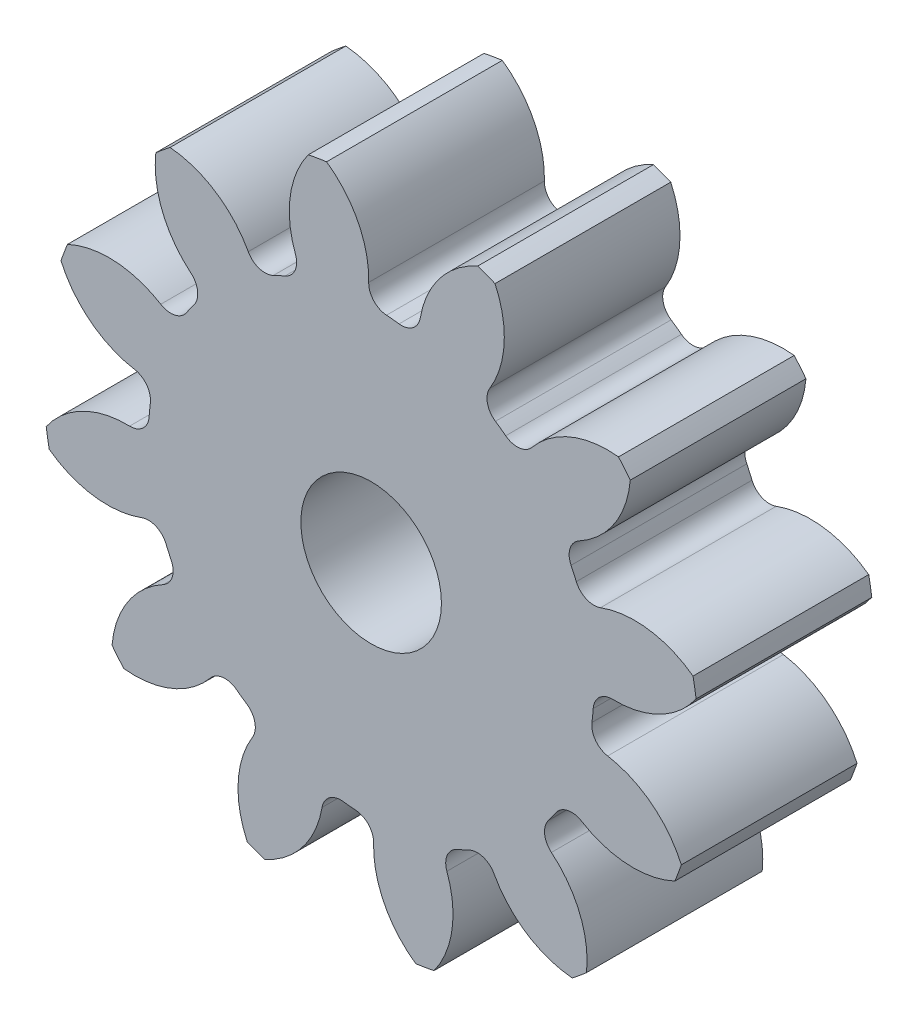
ISO-10303-21;
HEADER;
FILE_DESCRIPTION(('STEP AP214'),'2;1');
FILE_NAME('part.step','',(''),(''),'','','');
FILE_SCHEMA(('AUTOMOTIVE_DESIGN { 1 0 10303 214 1 1 1 1 }'));
ENDSEC;
DATA;
#1=APPLICATION_CONTEXT('core data for automotive mechanical design processes');
#2=APPLICATION_PROTOCOL_DEFINITION('international standard','automotive_design',2000,#1);
#3=PRODUCT_CONTEXT('',#1,'mechanical');
#4=PRODUCT('Part','Part','',(#3));
#5=PRODUCT_RELATED_PRODUCT_CATEGORY('part','',(#4));
#6=PRODUCT_DEFINITION_FORMATION('','',#4);
#7=PRODUCT_DEFINITION_CONTEXT('part definition',#1,'design');
#8=PRODUCT_DEFINITION('design','',#6,#7);
#9=PRODUCT_DEFINITION_SHAPE('','',#8);
#10=(LENGTH_UNIT() NAMED_UNIT(*) SI_UNIT(.MILLI.,.METRE.));
#11=(NAMED_UNIT(*) PLANE_ANGLE_UNIT() SI_UNIT($,.RADIAN.));
#12=(NAMED_UNIT(*) SI_UNIT($,.STERADIAN.) SOLID_ANGLE_UNIT());
#13=UNCERTAINTY_MEASURE_WITH_UNIT(LENGTH_MEASURE(1.E-05),#10,'distance_accuracy_value','');
#14=(GEOMETRIC_REPRESENTATION_CONTEXT(3) GLOBAL_UNCERTAINTY_ASSIGNED_CONTEXT((#13)) GLOBAL_UNIT_ASSIGNED_CONTEXT((#10,
#11,#12)) REPRESENTATION_CONTEXT('',''));
#15=CARTESIAN_POINT('',(0.,0.,0.));
#16=DIRECTION('',(0.,0.,1.));
#17=DIRECTION('',(1.,0.,0.));
#18=AXIS2_PLACEMENT_3D('',#15,#16,#17);
#19=CARTESIAN_POINT('',(0.,0.,127.));
#20=DIRECTION('',(0.,0.,-1.));
#21=DIRECTION('',(-1.,0.,0.));
#22=AXIS2_PLACEMENT_3D('',#19,#20,#21);
#23=CYLINDRICAL_SURFACE('',#22,237.066666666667);
#24=DIRECTION('',(0.,0.,-1.));
#25=VECTOR('',#24,1.);
#26=CARTESIAN_POINT('',(232.677253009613,45.4081531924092,63.5));
#27=LINE('',#26,#25);
#28=CARTESIAN_POINT('',(232.677253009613,45.4081531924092,127.));
#29=VERTEX_POINT('',#28);
#30=CARTESIAN_POINT('',(232.677253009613,45.4081531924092,0.));
#31=VERTEX_POINT('',#30);
#32=EDGE_CURVE('E528',#29,#31,#27,.T.);
#33=ORIENTED_EDGE('',*,*,#32,.F.);
#34=CARTESIAN_POINT('',(0.,0.,127.));
#35=DIRECTION('',(0.,0.,1.));
#36=DIRECTION('',(1.,0.,0.));
#37=AXIS2_PLACEMENT_3D('',#34,#35,#36);
#38=CIRCLE('',#37,237.066666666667);
#39=CARTESIAN_POINT('',(234.868932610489,32.2054178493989,127.));
#40=VERTEX_POINT('',#39);
#41=EDGE_CURVE('E945',#40,#29,#38,.T.);
#42=ORIENTED_EDGE('',*,*,#41,.F.);
#43=DIRECTION('',(0.,0.,-1.));
#44=VECTOR('',#43,1.);
#45=CARTESIAN_POINT('',(234.868932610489,32.2054178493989,63.5));
#46=LINE('',#45,#44);
#47=CARTESIAN_POINT('',(234.868932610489,32.2054178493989,0.));
#48=VERTEX_POINT('',#47);
#49=EDGE_CURVE('E939',#48,#40,#46,.F.);
#50=ORIENTED_EDGE('',*,*,#49,.F.);
#51=CARTESIAN_POINT('',(0.,0.,0.));
#52=DIRECTION('',(0.,0.,1.));
#53=DIRECTION('',(1.,0.,0.));
#54=AXIS2_PLACEMENT_3D('',#51,#52,#53);
#55=CIRCLE('',#54,237.066666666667);
#56=EDGE_CURVE('E950',#48,#31,#55,.T.);
#57=ORIENTED_EDGE('',*,*,#56,.T.);
#58=EDGE_LOOP('',(#33,#42,#50,#57));
#59=FACE_BOUND('',#58,.T.);
#60=ADVANCED_FACE('F33',(#59),#23,.T.);
#61=DIRECTION('',(0.,0.,-1.));
#62=VECTOR('',#61,1.);
#63=CARTESIAN_POINT('',(187.299753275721,145.325176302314,63.5));
#64=LINE('',#63,#62);
#65=CARTESIAN_POINT('',(187.299753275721,145.325176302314,0.));
#66=VERTEX_POINT('',#65);
#67=CARTESIAN_POINT('',(187.299753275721,145.325176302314,127.));
#68=VERTEX_POINT('',#67);
#69=EDGE_CURVE('E499',#66,#68,#64,.F.);
#70=ORIENTED_EDGE('',*,*,#69,.F.);
#71=CARTESIAN_POINT('',(178.800335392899,155.663240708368,0.));
#72=VERTEX_POINT('',#71);
#73=EDGE_CURVE('E953',#66,#72,#55,.T.);
#74=ORIENTED_EDGE('',*,*,#73,.T.);
#75=DIRECTION('',(0.,0.,-1.));
#76=VECTOR('',#75,1.);
#77=CARTESIAN_POINT('',(178.800335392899,155.663240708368,63.5));
#78=LINE('',#77,#76);
#79=CARTESIAN_POINT('',(178.800335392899,155.663240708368,127.));
#80=VERTEX_POINT('',#79);
#81=EDGE_CURVE('E561',#80,#72,#78,.T.);
#82=ORIENTED_EDGE('',*,*,#81,.F.);
#83=EDGE_CURVE('E948',#68,#80,#38,.T.);
#84=ORIENTED_EDGE('',*,*,#83,.F.);
#85=EDGE_LOOP('',(#70,#74,#82,#84));
#86=FACE_BOUND('',#85,.T.);
#87=ADVANCED_FACE('F1091',(#86),#23,.T.);
#88=CARTESIAN_POINT('',(0.,0.,127.));
#89=DIRECTION('',(0.,0.,1.));
#90=DIRECTION('',(1.,0.,0.));
#91=AXIS2_PLACEMENT_3D('',#88,#89,#90);
#92=PLANE('',#91);
#93=CARTESIAN_POINT('',(0.,0.,127.000000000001));
#94=DIRECTION('',(0.,0.,1.));
#95=DIRECTION('',(1.,0.,0.));
#96=AXIS2_PLACEMENT_3D('',#93,#94,#95);
#97=CIRCLE('',#96,50.8);
#98=CARTESIAN_POINT('',(50.8,0.,127.000000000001));
#99=VERTEX_POINT('',#98);
#100=EDGE_CURVE('E516',#99,#99,#97,.T.);
#101=ORIENTED_EDGE('',*,*,#100,.F.);
#102=EDGE_LOOP('',(#101));
#103=FACE_BOUND('',#102,.T.);
#104=ORIENTED_EDGE('',*,*,#41,.T.);
#105=CARTESIAN_POINT('',(190.558328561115,-12.1541297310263,127.));
#106=DIRECTION('',(0.,0.,-1.));
#107=DIRECTION('',(0.866025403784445,0.499999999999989,0.));
#108=AXIS2_PLACEMENT_3D('',#105,#106,#107);
#109=CIRCLE('',#108,71.3261537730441);
#110=CARTESIAN_POINT('',(165.796356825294,54.7358169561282,127.));
#111=VERTEX_POINT('',#110);
#112=EDGE_CURVE('E508',#111,#29,#109,.T.);
#113=ORIENTED_EDGE('',*,*,#112,.F.);
#114=CARTESIAN_POINT('',(161.011121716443,67.6622561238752,127.));
#115=DIRECTION('',(0.,0.,1.));
#116=DIRECTION('',(-0.866025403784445,-0.499999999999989,0.));
#117=AXIS2_PLACEMENT_3D('',#114,#115,#116);
#118=CIRCLE('',#117,13.7837333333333);
#119=CARTESIAN_POINT('',(148.303825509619,62.3222254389,127.));
#120=VERTEX_POINT('',#119);
#121=EDGE_CURVE('E506',#120,#111,#118,.T.);
#122=ORIENTED_EDGE('',*,*,#121,.F.);
#123=CARTESIAN_POINT('',(0.,0.,127.));
#124=DIRECTION('',(0.,0.,-1.));
#125=DIRECTION('',(0.866025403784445,0.499999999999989,0.));
#126=AXIS2_PLACEMENT_3D('',#123,#124,#125);
#127=CIRCLE('',#126,160.866666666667);
#128=CARTESIAN_POINT('',(144.516085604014,70.662475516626,127.));
#129=VERTEX_POINT('',#128);
#130=EDGE_CURVE('E491',#129,#120,#127,.T.);
#131=ORIENTED_EDGE('',*,*,#130,.F.);
#132=CARTESIAN_POINT('',(156.898832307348,76.7171339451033,127.));
#133=DIRECTION('',(0.,0.,1.));
#134=DIRECTION('',(-0.866025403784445,-0.499999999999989,0.));
#135=AXIS2_PLACEMENT_3D('',#132,#133,#134);
#136=CIRCLE('',#135,13.7837333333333);
#137=CARTESIAN_POINT('',(150.314090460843,88.8263238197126,127.));
#138=VERTEX_POINT('',#137);
#139=EDGE_CURVE('E483',#138,#129,#136,.T.);
#140=ORIENTED_EDGE('',*,*,#139,.F.);
#141=CARTESIAN_POINT('',(116.240280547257,151.487282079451,127.));
#142=DIRECTION('',(0.,0.,-1.));
#143=DIRECTION('',(-0.866025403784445,-0.499999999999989,0.));
#144=AXIS2_PLACEMENT_3D('',#141,#142,#143);
#145=CIRCLE('',#144,71.3261537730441);
#146=EDGE_CURVE('E513',#68,#138,#145,.T.);
#147=ORIENTED_EDGE('',*,*,#146,.F.);
#148=ORIENTED_EDGE('',*,*,#83,.T.);
#149=CARTESIAN_POINT('',(171.10541830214,84.753379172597,127.));
#150=DIRECTION('',(0.,0.,-1.));
#151=DIRECTION('',(0.50000000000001,0.866025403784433,0.));
#152=AXIS2_PLACEMENT_3D('',#149,#150,#151);
#153=CIRCLE('',#152,71.3261537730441);
#154=CARTESIAN_POINT('',(116.21594838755,130.300786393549,127.));
#155=VERTEX_POINT('',#154);
#156=EDGE_CURVE('E537',#155,#80,#153,.T.);
#157=ORIENTED_EDGE('',*,*,#156,.F.);
#158=CARTESIAN_POINT('',(105.60859363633,139.102793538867,127.));
#159=DIRECTION('',(0.,0.,1.));
#160=DIRECTION('',(-0.50000000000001,-0.866025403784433,0.));
#161=AXIS2_PLACEMENT_3D('',#158,#159,#160);
#162=CIRCLE('',#161,13.7837333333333);
#163=CARTESIAN_POINT('',(97.2737676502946,128.124543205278,127.));
#164=VERTEX_POINT('',#163);
#165=EDGE_CURVE('E535',#164,#155,#162,.T.);
#166=ORIENTED_EDGE('',*,*,#165,.F.);
#167=CARTESIAN_POINT('',(0.,0.,127.));
#168=DIRECTION('',(0.,0.,-1.));
#169=DIRECTION('',(0.50000000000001,0.866025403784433,0.));
#170=AXIS2_PLACEMENT_3D('',#167,#168,#169);
#171=CIRCLE('',#170,160.866666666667);
#172=CARTESIAN_POINT('',(89.8233636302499,133.453541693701,127.));
#173=VERTEX_POINT('',#172);
#174=EDGE_CURVE('E532',#173,#164,#171,.T.);
#175=ORIENTED_EDGE('',*,*,#174,.F.);
#176=CARTESIAN_POINT('',(97.5198076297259,144.888403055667,127.));
#177=DIRECTION('',(0.,0.,1.));
#178=DIRECTION('',(-0.50000000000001,-0.866025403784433,0.));
#179=AXIS2_PLACEMENT_3D('',#176,#177,#178);
#180=CIRCLE('',#179,13.7837333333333);
#181=CARTESIAN_POINT('',(85.7626589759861,152.082898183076,127.));
#182=VERTEX_POINT('',#181);
#183=EDGE_CURVE('E530',#182,#173,#180,.T.);
#184=ORIENTED_EDGE('',*,*,#183,.F.);
#185=CARTESIAN_POINT('',(24.9233948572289,189.311974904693,127.));
#186=DIRECTION('',(0.,0.,-1.));
#187=DIRECTION('',(-0.50000000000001,-0.866025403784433,0.));
#188=AXIS2_PLACEMENT_3D('',#185,#186,#187);
#189=CIRCLE('',#188,71.3261537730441);
#190=CARTESIAN_POINT('',(89.5437563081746,219.505171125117,127.));
#191=VERTEX_POINT('',#190);
#192=EDGE_CURVE('E540',#191,#182,#189,.T.);
#193=ORIENTED_EDGE('',*,*,#192,.F.);
#194=CARTESIAN_POINT('',(77.014012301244,224.208488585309,127.));
#195=VERTEX_POINT('',#194);
#196=EDGE_CURVE('E985',#191,#195,#38,.T.);
#197=ORIENTED_EDGE('',*,*,#196,.T.);
#198=CARTESIAN_POINT('',(105.804949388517,158.951288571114,127.));
#199=DIRECTION('',(0.,0.,-1.));
#200=DIRECTION('',(0.,1.,0.));
#201=AXIS2_PLACEMENT_3D('',#198,#199,#200);
#202=CIRCLE('',#201,71.3261537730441);
#203=CARTESIAN_POINT('',(35.4955704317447,170.951765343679,127.));
#204=VERTEX_POINT('',#203);
#205=EDGE_CURVE('E572',#204,#195,#202,.T.);
#206=ORIENTED_EDGE('',*,*,#205,.F.);
#207=CARTESIAN_POINT('',(21.908328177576,173.270849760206,127.));
#208=DIRECTION('',(0.,0.,1.));
#209=DIRECTION('',(0.,-1.,0.));
#210=AXIS2_PLACEMENT_3D('',#207,#208,#209);
#211=CIRCLE('',#210,13.7837333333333);
#212=CARTESIAN_POINT('',(20.179282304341,159.595993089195,127.));
#213=VERTEX_POINT('',#212);
#214=EDGE_CURVE('E570',#213,#204,#211,.T.);
#215=ORIENTED_EDGE('',*,*,#214,.F.);
#216=CARTESIAN_POINT('',(0.,0.,127.));
#217=DIRECTION('',(0.,0.,-1.));
#218=DIRECTION('',(0.,1.,0.));
#219=AXIS2_PLACEMENT_3D('',#216,#217,#218);
#220=CIRCLE('',#219,160.866666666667);
#221=CARTESIAN_POINT('',(11.0625439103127,160.485839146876,127.));
#222=VERTEX_POINT('',#221);
#223=EDGE_CURVE('E567',#222,#213,#220,.T.);
#224=ORIENTED_EDGE('',*,*,#223,.F.);
#225=CARTESIAN_POINT('',(12.0104292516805,174.236941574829,127.));
#226=DIRECTION('',(0.,0.,1.));
#227=DIRECTION('',(0.,-1.,0.));
#228=AXIS2_PLACEMENT_3D('',#225,#226,#227);
#229=CIRCLE('',#228,13.7837333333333);
#230=CARTESIAN_POINT('',(-1.76880772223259,174.588982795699,127.));
#231=VERTEX_POINT('',#230);
#232=EDGE_CURVE('E565',#231,#222,#229,.T.);
#233=ORIENTED_EDGE('',*,*,#232,.F.);
#234=CARTESIAN_POINT('',(-73.0716943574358,176.41067693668,127.));
#235=DIRECTION('',(0.,0.,-1.));
#236=DIRECTION('',(0.,-1.,0.));
#237=AXIS2_PLACEMENT_3D('',#234,#235,#236);
#238=CIRCLE('',#237,71.3261537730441);
#239=CARTESIAN_POINT('',(-32.2054178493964,234.868932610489,127.));
#240=VERTEX_POINT('',#239);
#241=EDGE_CURVE('E575',#240,#231,#238,.T.);
#242=ORIENTED_EDGE('',*,*,#241,.F.);
#243=CARTESIAN_POINT('',(-45.40815319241,232.677253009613,127.));
#244=VERTEX_POINT('',#243);
#245=EDGE_CURVE('E1073',#240,#244,#38,.T.);
#246=ORIENTED_EDGE('',*,*,#245,.T.);
#247=CARTESIAN_POINT('',(12.1541297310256,190.558328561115,127.));
#248=DIRECTION('',(0.,0.,-1.));
#249=DIRECTION('',(-0.499999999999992,0.866025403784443,0.));
#250=AXIS2_PLACEMENT_3D('',#247,#248,#249);
#251=CIRCLE('',#250,71.3261537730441);
#252=CARTESIAN_POINT('',(-54.7358169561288,165.796356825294,127.));
#253=VERTEX_POINT('',#252);
#254=EDGE_CURVE('E610',#253,#244,#251,.T.);
#255=ORIENTED_EDGE('',*,*,#254,.F.);
#256=CARTESIAN_POINT('',(-67.6622561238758,161.011121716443,127.));
#257=DIRECTION('',(0.,0.,1.));
#258=DIRECTION('',(0.499999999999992,-0.866025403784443,0.));
#259=AXIS2_PLACEMENT_3D('',#256,#257,#258);
#260=CIRCLE('',#259,13.7837333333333);
#261=CARTESIAN_POINT('',(-62.3222254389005,148.303825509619,127.));
#262=VERTEX_POINT('',#261);
#263=EDGE_CURVE('E608',#262,#253,#260,.T.);
#264=ORIENTED_EDGE('',*,*,#263,.F.);
#265=CARTESIAN_POINT('',(0.,0.,127.));
#266=DIRECTION('',(0.,0.,-1.));
#267=DIRECTION('',(-0.499999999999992,0.866025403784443,0.));
#268=AXIS2_PLACEMENT_3D('',#265,#266,#267);
#269=CIRCLE('',#268,160.866666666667);
#270=CARTESIAN_POINT('',(-70.6624755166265,144.516085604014,127.));
#271=VERTEX_POINT('',#270);
#272=EDGE_CURVE('E605',#271,#262,#269,.T.);
#273=ORIENTED_EDGE('',*,*,#272,.F.);
#274=CARTESIAN_POINT('',(-76.7171339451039,156.898832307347,127.));
#275=DIRECTION('',(0.,0.,1.));
#276=DIRECTION('',(0.499999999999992,-0.866025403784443,0.));
#277=AXIS2_PLACEMENT_3D('',#274,#275,#276);
#278=CIRCLE('',#277,13.7837333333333);
#279=CARTESIAN_POINT('',(-88.8263238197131,150.314090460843,127.));
#280=VERTEX_POINT('',#279);
#281=EDGE_CURVE('E603',#280,#271,#278,.T.);
#282=ORIENTED_EDGE('',*,*,#281,.F.);
#283=CARTESIAN_POINT('',(-151.487282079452,116.240280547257,127.));
#284=DIRECTION('',(0.,0.,-1.));
#285=DIRECTION('',(0.499999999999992,-0.866025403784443,0.));
#286=AXIS2_PLACEMENT_3D('',#283,#284,#285);
#287=CIRCLE('',#286,71.3261537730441);
#288=CARTESIAN_POINT('',(-145.325176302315,187.299753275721,127.));
#289=VERTEX_POINT('',#288);
#290=EDGE_CURVE('E613',#289,#280,#287,.T.);
#291=ORIENTED_EDGE('',*,*,#290,.F.);
#292=CARTESIAN_POINT('',(-155.663240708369,178.800335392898,127.));
#293=VERTEX_POINT('',#292);
#294=EDGE_CURVE('E1069',#289,#293,#38,.T.);
#295=ORIENTED_EDGE('',*,*,#294,.T.);
#296=CARTESIAN_POINT('',(-84.7533791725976,171.10541830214,127.));
#297=DIRECTION('',(0.,0.,-1.));
#298=DIRECTION('',(-0.866025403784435,0.500000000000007,0.));
#299=AXIS2_PLACEMENT_3D('',#296,#297,#298);
#300=CIRCLE('',#299,71.3261537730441);
#301=CARTESIAN_POINT('',(-130.30078639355,116.21594838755,127.));
#302=VERTEX_POINT('',#301);
#303=EDGE_CURVE('E648',#302,#293,#300,.T.);
#304=ORIENTED_EDGE('',*,*,#303,.F.);
#305=CARTESIAN_POINT('',(-139.102793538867,105.60859363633,127.));
#306=DIRECTION('',(0.,0.,1.));
#307=DIRECTION('',(0.866025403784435,-0.500000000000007,0.));
#308=AXIS2_PLACEMENT_3D('',#305,#306,#307);
#309=CIRCLE('',#308,13.7837333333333);
#310=CARTESIAN_POINT('',(-128.124543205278,97.2737676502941,127.));
#311=VERTEX_POINT('',#310);
#312=EDGE_CURVE('E646',#311,#302,#309,.T.);
#313=ORIENTED_EDGE('',*,*,#312,.F.);
#314=CARTESIAN_POINT('',(0.,0.,127.));
#315=DIRECTION('',(0.,0.,-1.));
#316=DIRECTION('',(-0.866025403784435,0.500000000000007,0.));
#317=AXIS2_PLACEMENT_3D('',#314,#315,#316);
#318=CIRCLE('',#317,160.866666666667);
#319=CARTESIAN_POINT('',(-133.453541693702,89.8233636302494,127.));
#320=VERTEX_POINT('',#319);
#321=EDGE_CURVE('E643',#320,#311,#318,.T.);
#322=ORIENTED_EDGE('',*,*,#321,.F.);
#323=CARTESIAN_POINT('',(-144.888403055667,97.5198076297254,127.));
#324=DIRECTION('',(0.,0.,1.));
#325=DIRECTION('',(0.866025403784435,-0.500000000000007,0.));
#326=AXIS2_PLACEMENT_3D('',#323,#324,#325);
#327=CIRCLE('',#326,13.7837333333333);
#328=CARTESIAN_POINT('',(-152.082898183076,85.7626589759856,127.));
#329=VERTEX_POINT('',#328);
#330=EDGE_CURVE('E641',#329,#320,#327,.T.);
#331=ORIENTED_EDGE('',*,*,#330,.F.);
#332=CARTESIAN_POINT('',(-189.311974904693,24.9233948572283,127.));
#333=DIRECTION('',(0.,0.,-1.));
#334=DIRECTION('',(0.866025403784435,-0.500000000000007,0.));
#335=AXIS2_PLACEMENT_3D('',#332,#333,#334);
#336=CIRCLE('',#335,71.3261537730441);
#337=CARTESIAN_POINT('',(-219.505171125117,89.5437563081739,127.));
#338=VERTEX_POINT('',#337);
#339=EDGE_CURVE('E651',#338,#329,#336,.T.);
#340=ORIENTED_EDGE('',*,*,#339,.F.);
#341=CARTESIAN_POINT('',(-224.208488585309,77.0140123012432,127.));
#342=VERTEX_POINT('',#341);
#343=EDGE_CURVE('E1065',#338,#342,#38,.T.);
#344=ORIENTED_EDGE('',*,*,#343,.T.);
#345=CARTESIAN_POINT('',(-158.951288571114,105.804949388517,127.));
#346=DIRECTION('',(0.,0.,-1.));
#347=DIRECTION('',(-1.,0.,0.));
#348=AXIS2_PLACEMENT_3D('',#345,#346,#347);
#349=CIRCLE('',#348,71.3261537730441);
#350=CARTESIAN_POINT('',(-170.951765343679,35.4955704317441,127.));
#351=VERTEX_POINT('',#350);
#352=EDGE_CURVE('E686',#351,#342,#349,.T.);
#353=ORIENTED_EDGE('',*,*,#352,.F.);
#354=CARTESIAN_POINT('',(-173.270849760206,21.9083281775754,127.));
#355=DIRECTION('',(0.,0.,1.));
#356=DIRECTION('',(1.,0.,0.));
#357=AXIS2_PLACEMENT_3D('',#354,#355,#356);
#358=CIRCLE('',#357,13.7837333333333);
#359=CARTESIAN_POINT('',(-159.595993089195,20.1792823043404,127.));
#360=VERTEX_POINT('',#359);
#361=EDGE_CURVE('E684',#360,#351,#358,.T.);
#362=ORIENTED_EDGE('',*,*,#361,.F.);
#363=CARTESIAN_POINT('',(0.,0.,127.));
#364=DIRECTION('',(0.,0.,-1.));
#365=DIRECTION('',(-1.,0.,0.));
#366=AXIS2_PLACEMENT_3D('',#363,#364,#365);
#367=CIRCLE('',#366,160.866666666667);
#368=CARTESIAN_POINT('',(-160.485839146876,11.0625439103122,127.));
#369=VERTEX_POINT('',#368);
#370=EDGE_CURVE('E681',#369,#360,#367,.T.);
#371=ORIENTED_EDGE('',*,*,#370,.F.);
#372=CARTESIAN_POINT('',(-174.236941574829,12.0104292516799,127.));
#373=DIRECTION('',(0.,0.,1.));
#374=DIRECTION('',(1.,0.,0.));
#375=AXIS2_PLACEMENT_3D('',#372,#373,#374);
#376=CIRCLE('',#375,13.7837333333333);
#377=CARTESIAN_POINT('',(-174.588982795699,-1.7688077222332,127.));
#378=VERTEX_POINT('',#377);
#379=EDGE_CURVE('E679',#378,#369,#376,.T.);
#380=ORIENTED_EDGE('',*,*,#379,.F.);
#381=CARTESIAN_POINT('',(-176.41067693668,-73.0716943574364,127.));
#382=DIRECTION('',(0.,0.,-1.));
#383=DIRECTION('',(1.,0.,0.));
#384=AXIS2_PLACEMENT_3D('',#381,#382,#383);
#385=CIRCLE('',#384,71.3261537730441);
#386=CARTESIAN_POINT('',(-234.868932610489,-32.2054178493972,127.));
#387=VERTEX_POINT('',#386);
#388=EDGE_CURVE('E689',#387,#378,#385,.T.);
#389=ORIENTED_EDGE('',*,*,#388,.F.);
#390=CARTESIAN_POINT('',(-232.677253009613,-45.4081531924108,127.));
#391=VERTEX_POINT('',#390);
#392=EDGE_CURVE('E1061',#387,#391,#38,.T.);
#393=ORIENTED_EDGE('',*,*,#392,.T.);
#394=CARTESIAN_POINT('',(-190.558328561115,12.1541297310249,127.));
#395=DIRECTION('',(0.,0.,-1.));
#396=DIRECTION('',(-0.866025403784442,-0.499999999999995,0.));
#397=AXIS2_PLACEMENT_3D('',#394,#395,#396);
#398=CIRCLE('',#397,71.3261537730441);
#399=CARTESIAN_POINT('',(-165.796356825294,-54.7358169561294,127.));
#400=VERTEX_POINT('',#399);
#401=EDGE_CURVE('E724',#400,#391,#398,.T.);
#402=ORIENTED_EDGE('',*,*,#401,.F.);
#403=CARTESIAN_POINT('',(-161.011121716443,-67.6622561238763,127.));
#404=DIRECTION('',(0.,0.,1.));
#405=DIRECTION('',(0.866025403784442,0.499999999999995,0.));
#406=AXIS2_PLACEMENT_3D('',#403,#404,#405);
#407=CIRCLE('',#406,13.7837333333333);
#408=CARTESIAN_POINT('',(-148.303825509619,-62.322225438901,127.));
#409=VERTEX_POINT('',#408);
#410=EDGE_CURVE('E722',#409,#400,#407,.T.);
#411=ORIENTED_EDGE('',*,*,#410,.F.);
#412=CARTESIAN_POINT('',(0.,0.,127.));
#413=DIRECTION('',(0.,0.,-1.));
#414=DIRECTION('',(-0.866025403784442,-0.499999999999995,0.));
#415=AXIS2_PLACEMENT_3D('',#412,#413,#414);
#416=CIRCLE('',#415,160.866666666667);
#417=CARTESIAN_POINT('',(-144.516085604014,-70.6624755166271,127.));
#418=VERTEX_POINT('',#417);
#419=EDGE_CURVE('E719',#418,#409,#416,.T.);
#420=ORIENTED_EDGE('',*,*,#419,.F.);
#421=CARTESIAN_POINT('',(-156.898832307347,-76.7171339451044,127.));
#422=DIRECTION('',(0.,0.,1.));
#423=DIRECTION('',(0.866025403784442,0.499999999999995,0.));
#424=AXIS2_PLACEMENT_3D('',#421,#422,#423);
#425=CIRCLE('',#424,13.7837333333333);
#426=CARTESIAN_POINT('',(-150.314090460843,-88.8263238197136,127.));
#427=VERTEX_POINT('',#426);
#428=EDGE_CURVE('E717',#427,#418,#425,.T.);
#429=ORIENTED_EDGE('',*,*,#428,.F.);
#430=CARTESIAN_POINT('',(-116.240280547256,-151.487282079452,127.));
#431=DIRECTION('',(0.,0.,-1.));
#432=DIRECTION('',(0.866025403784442,0.499999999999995,0.));
#433=AXIS2_PLACEMENT_3D('',#430,#431,#432);
#434=CIRCLE('',#433,71.3261537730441);
#435=CARTESIAN_POINT('',(-187.29975327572,-145.325176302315,127.));
#436=VERTEX_POINT('',#435);
#437=EDGE_CURVE('E727',#436,#427,#434,.T.);
#438=ORIENTED_EDGE('',*,*,#437,.F.);
#439=CARTESIAN_POINT('',(-178.800335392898,-155.66324070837,127.));
#440=VERTEX_POINT('',#439);
#441=EDGE_CURVE('E1057',#436,#440,#38,.T.);
#442=ORIENTED_EDGE('',*,*,#441,.T.);
#443=CARTESIAN_POINT('',(-171.105418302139,-84.7533791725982,127.));
#444=DIRECTION('',(0.,0.,-1.));
#445=DIRECTION('',(-0.500000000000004,-0.866025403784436,0.));
#446=AXIS2_PLACEMENT_3D('',#443,#444,#445);
#447=CIRCLE('',#446,71.3261537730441);
#448=CARTESIAN_POINT('',(-116.215948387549,-130.30078639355,127.));
#449=VERTEX_POINT('',#448);
#450=EDGE_CURVE('E762',#449,#440,#447,.T.);
#451=ORIENTED_EDGE('',*,*,#450,.F.);
#452=CARTESIAN_POINT('',(-105.608593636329,-139.102793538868,127.));
#453=DIRECTION('',(0.,0.,1.));
#454=DIRECTION('',(0.500000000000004,0.866025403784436,0.));
#455=AXIS2_PLACEMENT_3D('',#452,#453,#454);
#456=CIRCLE('',#455,13.7837333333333);
#457=CARTESIAN_POINT('',(-97.2737676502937,-128.124543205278,127.));
#458=VERTEX_POINT('',#457);
#459=EDGE_CURVE('E760',#458,#449,#456,.T.);
#460=ORIENTED_EDGE('',*,*,#459,.F.);
#461=CARTESIAN_POINT('',(0.,0.,127.));
#462=DIRECTION('',(0.,0.,-1.));
#463=DIRECTION('',(-0.500000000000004,-0.866025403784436,0.));
#464=AXIS2_PLACEMENT_3D('',#461,#462,#463);
#465=CIRCLE('',#464,160.866666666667);
#466=CARTESIAN_POINT('',(-89.823363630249,-133.453541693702,127.));
#467=VERTEX_POINT('',#466);
#468=EDGE_CURVE('E757',#467,#458,#465,.T.);
#469=ORIENTED_EDGE('',*,*,#468,.F.);
#470=CARTESIAN_POINT('',(-97.5198076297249,-144.888403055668,127.));
#471=DIRECTION('',(0.,0.,1.));
#472=DIRECTION('',(0.500000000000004,0.866025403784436,0.));
#473=AXIS2_PLACEMENT_3D('',#470,#471,#472);
#474=CIRCLE('',#473,13.7837333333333);
#475=CARTESIAN_POINT('',(-85.762658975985,-152.082898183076,127.));
#476=VERTEX_POINT('',#475);
#477=EDGE_CURVE('E755',#476,#467,#474,.T.);
#478=ORIENTED_EDGE('',*,*,#477,.F.);
#479=CARTESIAN_POINT('',(-24.9233948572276,-189.311974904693,127.));
#480=DIRECTION('',(0.,0.,-1.));
#481=DIRECTION('',(0.500000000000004,0.866025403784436,0.));
#482=AXIS2_PLACEMENT_3D('',#479,#480,#481);
#483=CIRCLE('',#482,71.3261537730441);
#484=CARTESIAN_POINT('',(-89.5437563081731,-219.505171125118,127.));
#485=VERTEX_POINT('',#484);
#486=EDGE_CURVE('E765',#485,#476,#483,.T.);
#487=ORIENTED_EDGE('',*,*,#486,.F.);
#488=CARTESIAN_POINT('',(-77.0140123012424,-224.208488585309,127.));
#489=VERTEX_POINT('',#488);
#490=EDGE_CURVE('E1053',#485,#489,#38,.T.);
#491=ORIENTED_EDGE('',*,*,#490,.T.);
#492=CARTESIAN_POINT('',(-105.804949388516,-158.951288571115,127.));
#493=DIRECTION('',(0.,0.,-1.));
#494=DIRECTION('',(0.,-1.,0.));
#495=AXIS2_PLACEMENT_3D('',#492,#493,#494);
#496=CIRCLE('',#495,71.3261537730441);
#497=CARTESIAN_POINT('',(-35.4955704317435,-170.951765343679,127.));
#498=VERTEX_POINT('',#497);
#499=EDGE_CURVE('E800',#498,#489,#496,.T.);
#500=ORIENTED_EDGE('',*,*,#499,.F.);
#501=CARTESIAN_POINT('',(-21.9083281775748,-173.270849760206,127.));
#502=DIRECTION('',(0.,0.,1.));
#503=DIRECTION('',(0.,1.,0.));
#504=AXIS2_PLACEMENT_3D('',#501,#502,#503);
#505=CIRCLE('',#504,13.7837333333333);
#506=CARTESIAN_POINT('',(-20.1792823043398,-159.595993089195,127.));
#507=VERTEX_POINT('',#506);
#508=EDGE_CURVE('E798',#507,#498,#505,.T.);
#509=ORIENTED_EDGE('',*,*,#508,.F.);
#510=CARTESIAN_POINT('',(0.,0.,127.));
#511=DIRECTION('',(0.,0.,-1.));
#512=DIRECTION('',(0.,-1.,0.));
#513=AXIS2_PLACEMENT_3D('',#510,#511,#512);
#514=CIRCLE('',#513,160.866666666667);
#515=CARTESIAN_POINT('',(-11.0625439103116,-160.485839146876,127.));
#516=VERTEX_POINT('',#515);
#517=EDGE_CURVE('E795',#516,#507,#514,.T.);
#518=ORIENTED_EDGE('',*,*,#517,.F.);
#519=CARTESIAN_POINT('',(-12.0104292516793,-174.23694157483,127.));
#520=DIRECTION('',(0.,0.,1.));
#521=DIRECTION('',(0.,1.,0.));
#522=AXIS2_PLACEMENT_3D('',#519,#520,#521);
#523=CIRCLE('',#522,13.7837333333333);
#524=CARTESIAN_POINT('',(1.76880772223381,-174.588982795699,127.));
#525=VERTEX_POINT('',#524);
#526=EDGE_CURVE('E793',#525,#516,#523,.T.);
#527=ORIENTED_EDGE('',*,*,#526,.F.);
#528=CARTESIAN_POINT('',(73.071694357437,-176.41067693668,127.));
#529=DIRECTION('',(0.,0.,-1.));
#530=DIRECTION('',(0.,1.,0.));
#531=AXIS2_PLACEMENT_3D('',#528,#529,#530);
#532=CIRCLE('',#531,71.3261537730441);
#533=CARTESIAN_POINT('',(32.2054178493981,-234.868932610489,127.));
#534=VERTEX_POINT('',#533);
#535=EDGE_CURVE('E803',#534,#525,#532,.T.);
#536=ORIENTED_EDGE('',*,*,#535,.F.);
#537=CARTESIAN_POINT('',(45.4081531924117,-232.677253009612,127.));
#538=VERTEX_POINT('',#537);
#539=EDGE_CURVE('E1049',#534,#538,#38,.T.);
#540=ORIENTED_EDGE('',*,*,#539,.T.);
#541=CARTESIAN_POINT('',(-12.1541297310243,-190.558328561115,127.));
#542=DIRECTION('',(0.,0.,-1.));
#543=DIRECTION('',(0.499999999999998,-0.86602540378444,0.));
#544=AXIS2_PLACEMENT_3D('',#541,#542,#543);
#545=CIRCLE('',#544,71.3261537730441);
#546=CARTESIAN_POINT('',(54.7358169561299,-165.796356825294,127.));
#547=VERTEX_POINT('',#546);
#548=EDGE_CURVE('E838',#547,#538,#545,.T.);
#549=ORIENTED_EDGE('',*,*,#548,.F.);
#550=CARTESIAN_POINT('',(67.6622561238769,-161.011121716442,127.));
#551=DIRECTION('',(0.,0.,1.));
#552=DIRECTION('',(-0.499999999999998,0.86602540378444,0.));
#553=AXIS2_PLACEMENT_3D('',#550,#551,#552);
#554=CIRCLE('',#553,13.7837333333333);
#555=CARTESIAN_POINT('',(62.3222254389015,-148.303825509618,127.));
#556=VERTEX_POINT('',#555);
#557=EDGE_CURVE('E836',#556,#547,#554,.T.);
#558=ORIENTED_EDGE('',*,*,#557,.F.);
#559=CARTESIAN_POINT('',(0.,0.,127.));
#560=DIRECTION('',(0.,0.,-1.));
#561=DIRECTION('',(0.499999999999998,-0.86602540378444,0.));
#562=AXIS2_PLACEMENT_3D('',#559,#560,#561);
#563=CIRCLE('',#562,160.866666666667);
#564=CARTESIAN_POINT('',(70.6624755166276,-144.516085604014,127.));
#565=VERTEX_POINT('',#564);
#566=EDGE_CURVE('E833',#565,#556,#563,.T.);
#567=ORIENTED_EDGE('',*,*,#566,.F.);
#568=CARTESIAN_POINT('',(76.717133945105,-156.898832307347,127.));
#569=DIRECTION('',(0.,0.,1.));
#570=DIRECTION('',(-0.499999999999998,0.86602540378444,0.));
#571=AXIS2_PLACEMENT_3D('',#568,#569,#570);
#572=CIRCLE('',#571,13.7837333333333);
#573=CARTESIAN_POINT('',(88.8263238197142,-150.314090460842,127.));
#574=VERTEX_POINT('',#573);
#575=EDGE_CURVE('E831',#574,#565,#572,.T.);
#576=ORIENTED_EDGE('',*,*,#575,.F.);
#577=CARTESIAN_POINT('',(151.487282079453,-116.240280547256,127.));
#578=DIRECTION('',(0.,0.,-1.));
#579=DIRECTION('',(-0.499999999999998,0.86602540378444,0.));
#580=AXIS2_PLACEMENT_3D('',#577,#578,#579);
#581=CIRCLE('',#580,71.3261537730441);
#582=CARTESIAN_POINT('',(145.325176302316,-187.299753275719,127.));
#583=VERTEX_POINT('',#582);
#584=EDGE_CURVE('E841',#583,#574,#581,.T.);
#585=ORIENTED_EDGE('',*,*,#584,.F.);
#586=CARTESIAN_POINT('',(155.66324070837,-178.800335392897,127.));
#587=VERTEX_POINT('',#586);
#588=EDGE_CURVE('E1048',#583,#587,#38,.T.);
#589=ORIENTED_EDGE('',*,*,#588,.T.);
#590=CARTESIAN_POINT('',(84.7533791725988,-171.105418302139,127.));
#591=DIRECTION('',(0.,0.,-1.));
#592=DIRECTION('',(0.866025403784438,-0.500000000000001,0.));
#593=AXIS2_PLACEMENT_3D('',#590,#591,#592);
#594=CIRCLE('',#593,71.3261537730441);
#595=CARTESIAN_POINT('',(130.300786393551,-116.215948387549,127.));
#596=VERTEX_POINT('',#595);
#597=EDGE_CURVE('E876',#596,#587,#594,.T.);
#598=ORIENTED_EDGE('',*,*,#597,.F.);
#599=CARTESIAN_POINT('',(139.102793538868,-105.608593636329,127.));
#600=DIRECTION('',(0.,0.,1.));
#601=DIRECTION('',(-0.866025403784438,0.500000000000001,0.));
#602=AXIS2_PLACEMENT_3D('',#599,#600,#601);
#603=CIRCLE('',#602,13.7837333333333);
#604=CARTESIAN_POINT('',(128.124543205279,-97.2737676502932,127.));
#605=VERTEX_POINT('',#604);
#606=EDGE_CURVE('E874',#605,#596,#603,.T.);
#607=ORIENTED_EDGE('',*,*,#606,.F.);
#608=CARTESIAN_POINT('',(0.,0.,127.));
#609=DIRECTION('',(0.,0.,-1.));
#610=DIRECTION('',(0.866025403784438,-0.500000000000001,0.));
#611=AXIS2_PLACEMENT_3D('',#608,#609,#610);
#612=CIRCLE('',#611,160.866666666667);
#613=CARTESIAN_POINT('',(133.453541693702,-89.8233636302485,127.));
#614=VERTEX_POINT('',#613);
#615=EDGE_CURVE('E871',#614,#605,#612,.T.);
#616=ORIENTED_EDGE('',*,*,#615,.F.);
#617=CARTESIAN_POINT('',(144.888403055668,-97.5198076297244,127.));
#618=DIRECTION('',(0.,0.,1.));
#619=DIRECTION('',(-0.866025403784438,0.500000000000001,0.));
#620=AXIS2_PLACEMENT_3D('',#617,#618,#619);
#621=CIRCLE('',#620,13.7837333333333);
#622=CARTESIAN_POINT('',(152.082898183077,-85.7626589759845,127.));
#623=VERTEX_POINT('',#622);
#624=EDGE_CURVE('E869',#623,#614,#621,.T.);
#625=ORIENTED_EDGE('',*,*,#624,.F.);
#626=CARTESIAN_POINT('',(189.311974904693,-24.9233948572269,127.));
#627=DIRECTION('',(0.,0.,-1.));
#628=DIRECTION('',(-0.866025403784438,0.500000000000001,0.));
#629=AXIS2_PLACEMENT_3D('',#626,#627,#628);
#630=CIRCLE('',#629,71.3261537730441);
#631=CARTESIAN_POINT('',(219.505171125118,-89.5437563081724,127.));
#632=VERTEX_POINT('',#631);
#633=EDGE_CURVE('E879',#632,#623,#630,.T.);
#634=ORIENTED_EDGE('',*,*,#633,.F.);
#635=CARTESIAN_POINT('',(224.208488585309,-77.0140123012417,127.));
#636=VERTEX_POINT('',#635);
#637=EDGE_CURVE('E949',#632,#636,#38,.T.);
#638=ORIENTED_EDGE('',*,*,#637,.T.);
#639=CARTESIAN_POINT('',(158.951288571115,-105.804949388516,127.));
#640=DIRECTION('',(0.,0.,-1.));
#641=DIRECTION('',(1.,0.,0.));
#642=AXIS2_PLACEMENT_3D('',#639,#640,#641);
#643=CIRCLE('',#642,71.3261537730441);
#644=CARTESIAN_POINT('',(170.951765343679,-35.4955704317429,127.));
#645=VERTEX_POINT('',#644);
#646=EDGE_CURVE('E914',#645,#636,#643,.T.);
#647=ORIENTED_EDGE('',*,*,#646,.F.);
#648=CARTESIAN_POINT('',(173.270849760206,-21.9083281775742,127.));
#649=DIRECTION('',(0.,0.,1.));
#650=DIRECTION('',(-1.,0.,0.));
#651=AXIS2_PLACEMENT_3D('',#648,#649,#650);
#652=CIRCLE('',#651,13.7837333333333);
#653=CARTESIAN_POINT('',(159.595993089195,-20.1792823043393,127.));
#654=VERTEX_POINT('',#653);
#655=EDGE_CURVE('E912',#654,#645,#652,.T.);
#656=ORIENTED_EDGE('',*,*,#655,.F.);
#657=CARTESIAN_POINT('',(0.,0.,127.));
#658=DIRECTION('',(0.,0.,-1.));
#659=DIRECTION('',(1.,0.,0.));
#660=AXIS2_PLACEMENT_3D('',#657,#658,#659);
#661=CIRCLE('',#660,160.866666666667);
#662=CARTESIAN_POINT('',(160.485839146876,-11.0625439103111,127.));
#663=VERTEX_POINT('',#662);
#664=EDGE_CURVE('E909',#663,#654,#661,.T.);
#665=ORIENTED_EDGE('',*,*,#664,.F.);
#666=CARTESIAN_POINT('',(174.23694157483,-12.0104292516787,127.));
#667=DIRECTION('',(0.,0.,1.));
#668=DIRECTION('',(-1.,0.,0.));
#669=AXIS2_PLACEMENT_3D('',#666,#667,#668);
#670=CIRCLE('',#669,13.7837333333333);
#671=CARTESIAN_POINT('',(174.588982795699,1.76880772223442,127.));
#672=VERTEX_POINT('',#671);
#673=EDGE_CURVE('E907',#672,#663,#670,.T.);
#674=ORIENTED_EDGE('',*,*,#673,.F.);
#675=CARTESIAN_POINT('',(176.410676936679,73.0716943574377,127.));
#676=DIRECTION('',(0.,0.,-1.));
#677=DIRECTION('',(-1.,0.,0.));
#678=AXIS2_PLACEMENT_3D('',#675,#676,#677);
#679=CIRCLE('',#678,71.3261537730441);
#680=EDGE_CURVE('E917',#40,#672,#679,.T.);
#681=ORIENTED_EDGE('',*,*,#680,.F.);
#682=EDGE_LOOP('',(#104,#113,#122,#131,#140,#147,#148,#157,#166,#175,#184,#193,#197,#206,#215,
#224,#233,#242,#246,#255,#264,#273,#282,#291,#295,#304,#313,#322,#331,#340,#344,#353,#362,#371,
#380,#389,#393,#402,#411,#420,#429,#438,#442,#451,#460,#469,#478,#487,#491,#500,#509,#518,#527,
#536,#540,#549,#558,#567,#576,#585,#589,#598,#607,#616,#625,#634,#638,#647,#656,#665,#674,#681));
#683=FACE_BOUND('',#682,.T.);
#684=ADVANCED_FACE('F504',(#103,#683),#92,.T.);
#685=CARTESIAN_POINT('',(0.,0.,0.));
#686=DIRECTION('',(0.,0.,1.));
#687=DIRECTION('',(1.,0.,0.));
#688=AXIS2_PLACEMENT_3D('',#685,#686,#687);
#689=PLANE('',#688);
#690=CARTESIAN_POINT('',(0.,0.,0.));
#691=DIRECTION('',(0.,0.,1.));
#692=DIRECTION('',(1.,0.,0.));
#693=AXIS2_PLACEMENT_3D('',#690,#691,#692);
#694=CIRCLE('',#693,50.8);
#695=CARTESIAN_POINT('',(50.8,0.,-1.77635683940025E-12));
#696=VERTEX_POINT('',#695);
#697=EDGE_CURVE('E36',#696,#696,#694,.T.);
#698=ORIENTED_EDGE('',*,*,#697,.T.);
#699=EDGE_LOOP('',(#698));
#700=FACE_BOUND('',#699,.T.);
#701=CARTESIAN_POINT('',(190.558328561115,-12.1541297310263,0.));
#702=DIRECTION('',(0.,0.,-1.));
#703=DIRECTION('',(0.866025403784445,0.499999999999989,0.));
#704=AXIS2_PLACEMENT_3D('',#701,#702,#703);
#705=CIRCLE('',#704,71.3261537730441);
#706=CARTESIAN_POINT('',(165.796356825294,54.7358169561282,0.));
#707=VERTEX_POINT('',#706);
#708=EDGE_CURVE('E492',#707,#31,#705,.T.);
#709=ORIENTED_EDGE('',*,*,#708,.T.);
#710=ORIENTED_EDGE('',*,*,#56,.F.);
#711=CARTESIAN_POINT('',(176.410676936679,73.0716943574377,0.));
#712=DIRECTION('',(0.,0.,1.));
#713=DIRECTION('',(1.,0.,0.));
#714=AXIS2_PLACEMENT_3D('',#711,#712,#713);
#715=CIRCLE('',#714,71.3261537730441);
#716=CARTESIAN_POINT('',(174.588982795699,1.76880772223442,0.));
#717=VERTEX_POINT('',#716);
#718=EDGE_CURVE('E947',#717,#48,#715,.T.);
#719=ORIENTED_EDGE('',*,*,#718,.F.);
#720=CARTESIAN_POINT('',(174.23694157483,-12.0104292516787,0.));
#721=DIRECTION('',(0.,0.,1.));
#722=DIRECTION('',(-1.,0.,0.));
#723=AXIS2_PLACEMENT_3D('',#720,#721,#722);
#724=CIRCLE('',#723,13.7837333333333);
#725=CARTESIAN_POINT('',(160.485839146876,-11.0625439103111,0.));
#726=VERTEX_POINT('',#725);
#727=EDGE_CURVE('E906',#717,#726,#724,.T.);
#728=ORIENTED_EDGE('',*,*,#727,.T.);
#729=CARTESIAN_POINT('',(0.,0.,0.));
#730=DIRECTION('',(0.,0.,-1.));
#731=DIRECTION('',(1.,0.,0.));
#732=AXIS2_PLACEMENT_3D('',#729,#730,#731);
#733=CIRCLE('',#732,160.866666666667);
#734=CARTESIAN_POINT('',(159.595993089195,-20.1792823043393,0.));
#735=VERTEX_POINT('',#734);
#736=EDGE_CURVE('E922',#726,#735,#733,.T.);
#737=ORIENTED_EDGE('',*,*,#736,.T.);
#738=CARTESIAN_POINT('',(173.270849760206,-21.9083281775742,0.));
#739=DIRECTION('',(0.,0.,1.));
#740=DIRECTION('',(-1.,0.,0.));
#741=AXIS2_PLACEMENT_3D('',#738,#739,#740);
#742=CIRCLE('',#741,13.7837333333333);
#743=CARTESIAN_POINT('',(170.951765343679,-35.4955704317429,0.));
#744=VERTEX_POINT('',#743);
#745=EDGE_CURVE('E925',#735,#744,#742,.T.);
#746=ORIENTED_EDGE('',*,*,#745,.T.);
#747=CARTESIAN_POINT('',(158.951288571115,-105.804949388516,0.));
#748=DIRECTION('',(0.,0.,-1.));
#749=DIRECTION('',(1.,0.,0.));
#750=AXIS2_PLACEMENT_3D('',#747,#748,#749);
#751=CIRCLE('',#750,71.3261537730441);
#752=CARTESIAN_POINT('',(224.208488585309,-77.0140123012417,0.));
#753=VERTEX_POINT('',#752);
#754=EDGE_CURVE('E910',#744,#753,#751,.T.);
#755=ORIENTED_EDGE('',*,*,#754,.T.);
#756=CARTESIAN_POINT('',(219.505171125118,-89.5437563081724,0.));
#757=VERTEX_POINT('',#756);
#758=EDGE_CURVE('E944',#757,#753,#55,.T.);
#759=ORIENTED_EDGE('',*,*,#758,.F.);
#760=CARTESIAN_POINT('',(189.311974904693,-24.9233948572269,0.));
#761=DIRECTION('',(0.,0.,1.));
#762=DIRECTION('',(1.,0.,0.));
#763=AXIS2_PLACEMENT_3D('',#760,#761,#762);
#764=CIRCLE('',#763,71.3261537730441);
#765=CARTESIAN_POINT('',(152.082898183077,-85.7626589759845,0.));
#766=VERTEX_POINT('',#765);
#767=EDGE_CURVE('E955',#766,#757,#764,.T.);
#768=ORIENTED_EDGE('',*,*,#767,.F.);
#769=CARTESIAN_POINT('',(144.888403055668,-97.5198076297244,0.));
#770=DIRECTION('',(0.,0.,1.));
#771=DIRECTION('',(-0.866025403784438,0.500000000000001,0.));
#772=AXIS2_PLACEMENT_3D('',#769,#770,#771);
#773=CIRCLE('',#772,13.7837333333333);
#774=CARTESIAN_POINT('',(133.453541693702,-89.8233636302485,0.));
#775=VERTEX_POINT('',#774);
#776=EDGE_CURVE('E868',#766,#775,#773,.T.);
#777=ORIENTED_EDGE('',*,*,#776,.T.);
#778=CARTESIAN_POINT('',(0.,0.,0.));
#779=DIRECTION('',(0.,0.,-1.));
#780=DIRECTION('',(0.866025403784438,-0.500000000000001,0.));
#781=AXIS2_PLACEMENT_3D('',#778,#779,#780);
#782=CIRCLE('',#781,160.866666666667);
#783=CARTESIAN_POINT('',(128.124543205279,-97.2737676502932,0.));
#784=VERTEX_POINT('',#783);
#785=EDGE_CURVE('E884',#775,#784,#782,.T.);
#786=ORIENTED_EDGE('',*,*,#785,.T.);
#787=CARTESIAN_POINT('',(139.102793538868,-105.608593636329,0.));
#788=DIRECTION('',(0.,0.,1.));
#789=DIRECTION('',(-0.866025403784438,0.500000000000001,0.));
#790=AXIS2_PLACEMENT_3D('',#787,#788,#789);
#791=CIRCLE('',#790,13.7837333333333);
#792=CARTESIAN_POINT('',(130.300786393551,-116.215948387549,0.));
#793=VERTEX_POINT('',#792);
#794=EDGE_CURVE('E887',#784,#793,#791,.T.);
#795=ORIENTED_EDGE('',*,*,#794,.T.);
#796=CARTESIAN_POINT('',(84.7533791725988,-171.105418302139,0.));
#797=DIRECTION('',(0.,0.,-1.));
#798=DIRECTION('',(0.866025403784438,-0.500000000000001,0.));
#799=AXIS2_PLACEMENT_3D('',#796,#797,#798);
#800=CIRCLE('',#799,71.3261537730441);
#801=CARTESIAN_POINT('',(155.66324070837,-178.800335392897,0.));
#802=VERTEX_POINT('',#801);
#803=EDGE_CURVE('E872',#793,#802,#800,.T.);
#804=ORIENTED_EDGE('',*,*,#803,.T.);
#805=CARTESIAN_POINT('',(145.325176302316,-187.299753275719,0.));
#806=VERTEX_POINT('',#805);
#807=EDGE_CURVE('E1019',#806,#802,#55,.T.);
#808=ORIENTED_EDGE('',*,*,#807,.F.);
#809=CARTESIAN_POINT('',(151.487282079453,-116.240280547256,0.));
#810=DIRECTION('',(0.,0.,1.));
#811=DIRECTION('',(1.,0.,0.));
#812=AXIS2_PLACEMENT_3D('',#809,#810,#811);
#813=CIRCLE('',#812,71.3261537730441);
#814=CARTESIAN_POINT('',(88.8263238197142,-150.314090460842,0.));
#815=VERTEX_POINT('',#814);
#816=EDGE_CURVE('E957',#815,#806,#813,.T.);
#817=ORIENTED_EDGE('',*,*,#816,.F.);
#818=CARTESIAN_POINT('',(76.717133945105,-156.898832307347,0.));
#819=DIRECTION('',(0.,0.,1.));
#820=DIRECTION('',(-0.499999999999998,0.86602540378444,0.));
#821=AXIS2_PLACEMENT_3D('',#818,#819,#820);
#822=CIRCLE('',#821,13.7837333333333);
#823=CARTESIAN_POINT('',(70.6624755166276,-144.516085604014,0.));
#824=VERTEX_POINT('',#823);
#825=EDGE_CURVE('E830',#815,#824,#822,.T.);
#826=ORIENTED_EDGE('',*,*,#825,.T.);
#827=CARTESIAN_POINT('',(0.,0.,0.));
#828=DIRECTION('',(0.,0.,-1.));
#829=DIRECTION('',(0.499999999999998,-0.86602540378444,0.));
#830=AXIS2_PLACEMENT_3D('',#827,#828,#829);
#831=CIRCLE('',#830,160.866666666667);
#832=CARTESIAN_POINT('',(62.3222254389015,-148.303825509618,0.));
#833=VERTEX_POINT('',#832);
#834=EDGE_CURVE('E846',#824,#833,#831,.T.);
#835=ORIENTED_EDGE('',*,*,#834,.T.);
#836=CARTESIAN_POINT('',(67.6622561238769,-161.011121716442,0.));
#837=DIRECTION('',(0.,0.,1.));
#838=DIRECTION('',(-0.499999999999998,0.86602540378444,0.));
#839=AXIS2_PLACEMENT_3D('',#836,#837,#838);
#840=CIRCLE('',#839,13.7837333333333);
#841=CARTESIAN_POINT('',(54.7358169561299,-165.796356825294,0.));
#842=VERTEX_POINT('',#841);
#843=EDGE_CURVE('E849',#833,#842,#840,.T.);
#844=ORIENTED_EDGE('',*,*,#843,.T.);
#845=CARTESIAN_POINT('',(-12.1541297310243,-190.558328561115,0.));
#846=DIRECTION('',(0.,0.,-1.));
#847=DIRECTION('',(0.499999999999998,-0.86602540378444,0.));
#848=AXIS2_PLACEMENT_3D('',#845,#846,#847);
#849=CIRCLE('',#848,71.3261537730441);
#850=CARTESIAN_POINT('',(45.4081531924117,-232.677253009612,0.));
#851=VERTEX_POINT('',#850);
#852=EDGE_CURVE('E834',#842,#851,#849,.T.);
#853=ORIENTED_EDGE('',*,*,#852,.T.);
#854=CARTESIAN_POINT('',(32.2054178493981,-234.868932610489,0.));
#855=VERTEX_POINT('',#854);
#856=EDGE_CURVE('E1014',#855,#851,#55,.T.);
#857=ORIENTED_EDGE('',*,*,#856,.F.);
#858=CARTESIAN_POINT('',(73.071694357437,-176.41067693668,0.));
#859=DIRECTION('',(0.,0.,1.));
#860=DIRECTION('',(1.,0.,0.));
#861=AXIS2_PLACEMENT_3D('',#858,#859,#860);
#862=CIRCLE('',#861,71.3261537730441);
#863=CARTESIAN_POINT('',(1.76880772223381,-174.588982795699,0.));
#864=VERTEX_POINT('',#863);
#865=EDGE_CURVE('E959',#864,#855,#862,.T.);
#866=ORIENTED_EDGE('',*,*,#865,.F.);
#867=CARTESIAN_POINT('',(-12.0104292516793,-174.23694157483,0.));
#868=DIRECTION('',(0.,0.,1.));
#869=DIRECTION('',(0.,1.,0.));
#870=AXIS2_PLACEMENT_3D('',#867,#868,#869);
#871=CIRCLE('',#870,13.7837333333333);
#872=CARTESIAN_POINT('',(-11.0625439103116,-160.485839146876,0.));
#873=VERTEX_POINT('',#872);
#874=EDGE_CURVE('E792',#864,#873,#871,.T.);
#875=ORIENTED_EDGE('',*,*,#874,.T.);
#876=CARTESIAN_POINT('',(0.,0.,0.));
#877=DIRECTION('',(0.,0.,-1.));
#878=DIRECTION('',(0.,-1.,0.));
#879=AXIS2_PLACEMENT_3D('',#876,#877,#878);
#880=CIRCLE('',#879,160.866666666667);
#881=CARTESIAN_POINT('',(-20.1792823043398,-159.595993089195,0.));
#882=VERTEX_POINT('',#881);
#883=EDGE_CURVE('E808',#873,#882,#880,.T.);
#884=ORIENTED_EDGE('',*,*,#883,.T.);
#885=CARTESIAN_POINT('',(-21.9083281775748,-173.270849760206,0.));
#886=DIRECTION('',(0.,0.,1.));
#887=DIRECTION('',(0.,1.,0.));
#888=AXIS2_PLACEMENT_3D('',#885,#886,#887);
#889=CIRCLE('',#888,13.7837333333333);
#890=CARTESIAN_POINT('',(-35.4955704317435,-170.951765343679,0.));
#891=VERTEX_POINT('',#890);
#892=EDGE_CURVE('E811',#882,#891,#889,.T.);
#893=ORIENTED_EDGE('',*,*,#892,.T.);
#894=CARTESIAN_POINT('',(-105.804949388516,-158.951288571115,0.));
#895=DIRECTION('',(0.,0.,-1.));
#896=DIRECTION('',(0.,-1.,0.));
#897=AXIS2_PLACEMENT_3D('',#894,#895,#896);
#898=CIRCLE('',#897,71.3261537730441);
#899=CARTESIAN_POINT('',(-77.0140123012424,-224.208488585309,0.));
#900=VERTEX_POINT('',#899);
#901=EDGE_CURVE('E796',#891,#900,#898,.T.);
#902=ORIENTED_EDGE('',*,*,#901,.T.);
#903=CARTESIAN_POINT('',(-89.5437563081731,-219.505171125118,0.));
#904=VERTEX_POINT('',#903);
#905=EDGE_CURVE('E1009',#904,#900,#55,.T.);
#906=ORIENTED_EDGE('',*,*,#905,.F.);
#907=CARTESIAN_POINT('',(-24.9233948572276,-189.311974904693,0.));
#908=DIRECTION('',(0.,0.,1.));
#909=DIRECTION('',(1.,0.,0.));
#910=AXIS2_PLACEMENT_3D('',#907,#908,#909);
#911=CIRCLE('',#910,71.3261537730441);
#912=CARTESIAN_POINT('',(-85.762658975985,-152.082898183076,0.));
#913=VERTEX_POINT('',#912);
#914=EDGE_CURVE('E961',#913,#904,#911,.T.);
#915=ORIENTED_EDGE('',*,*,#914,.F.);
#916=CARTESIAN_POINT('',(-97.5198076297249,-144.888403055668,0.));
#917=DIRECTION('',(0.,0.,1.));
#918=DIRECTION('',(0.500000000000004,0.866025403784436,0.));
#919=AXIS2_PLACEMENT_3D('',#916,#917,#918);
#920=CIRCLE('',#919,13.7837333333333);
#921=CARTESIAN_POINT('',(-89.823363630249,-133.453541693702,0.));
#922=VERTEX_POINT('',#921);
#923=EDGE_CURVE('E754',#913,#922,#920,.T.);
#924=ORIENTED_EDGE('',*,*,#923,.T.);
#925=CARTESIAN_POINT('',(0.,0.,0.));
#926=DIRECTION('',(0.,0.,-1.));
#927=DIRECTION('',(-0.500000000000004,-0.866025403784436,0.));
#928=AXIS2_PLACEMENT_3D('',#925,#926,#927);
#929=CIRCLE('',#928,160.866666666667);
#930=CARTESIAN_POINT('',(-97.2737676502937,-128.124543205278,0.));
#931=VERTEX_POINT('',#930);
#932=EDGE_CURVE('E770',#922,#931,#929,.T.);
#933=ORIENTED_EDGE('',*,*,#932,.T.);
#934=CARTESIAN_POINT('',(-105.608593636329,-139.102793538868,0.));
#935=DIRECTION('',(0.,0.,1.));
#936=DIRECTION('',(0.500000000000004,0.866025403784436,0.));
#937=AXIS2_PLACEMENT_3D('',#934,#935,#936);
#938=CIRCLE('',#937,13.7837333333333);
#939=CARTESIAN_POINT('',(-116.215948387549,-130.30078639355,0.));
#940=VERTEX_POINT('',#939);
#941=EDGE_CURVE('E773',#931,#940,#938,.T.);
#942=ORIENTED_EDGE('',*,*,#941,.T.);
#943=CARTESIAN_POINT('',(-171.105418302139,-84.7533791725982,0.));
#944=DIRECTION('',(0.,0.,-1.));
#945=DIRECTION('',(-0.500000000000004,-0.866025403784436,0.));
#946=AXIS2_PLACEMENT_3D('',#943,#944,#945);
#947=CIRCLE('',#946,71.3261537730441);
#948=CARTESIAN_POINT('',(-178.800335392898,-155.66324070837,0.));
#949=VERTEX_POINT('',#948);
#950=EDGE_CURVE('E758',#940,#949,#947,.T.);
#951=ORIENTED_EDGE('',*,*,#950,.T.);
#952=CARTESIAN_POINT('',(-187.29975327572,-145.325176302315,0.));
#953=VERTEX_POINT('',#952);
#954=EDGE_CURVE('E1004',#953,#949,#55,.T.);
#955=ORIENTED_EDGE('',*,*,#954,.F.);
#956=CARTESIAN_POINT('',(-116.240280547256,-151.487282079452,0.));
#957=DIRECTION('',(0.,0.,1.));
#958=DIRECTION('',(1.,0.,0.));
#959=AXIS2_PLACEMENT_3D('',#956,#957,#958);
#960=CIRCLE('',#959,71.3261537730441);
#961=CARTESIAN_POINT('',(-150.314090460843,-88.8263238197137,0.));
#962=VERTEX_POINT('',#961);
#963=EDGE_CURVE('E963',#962,#953,#960,.T.);
#964=ORIENTED_EDGE('',*,*,#963,.F.);
#965=CARTESIAN_POINT('',(-156.898832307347,-76.7171339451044,0.));
#966=DIRECTION('',(0.,0.,1.));
#967=DIRECTION('',(0.866025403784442,0.499999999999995,0.));
#968=AXIS2_PLACEMENT_3D('',#965,#966,#967);
#969=CIRCLE('',#968,13.7837333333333);
#970=CARTESIAN_POINT('',(-144.516085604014,-70.6624755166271,0.));
#971=VERTEX_POINT('',#970);
#972=EDGE_CURVE('E716',#962,#971,#969,.T.);
#973=ORIENTED_EDGE('',*,*,#972,.T.);
#974=CARTESIAN_POINT('',(0.,0.,0.));
#975=DIRECTION('',(0.,0.,-1.));
#976=DIRECTION('',(-0.866025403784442,-0.499999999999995,0.));
#977=AXIS2_PLACEMENT_3D('',#974,#975,#976);
#978=CIRCLE('',#977,160.866666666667);
#979=CARTESIAN_POINT('',(-148.303825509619,-62.322225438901,0.));
#980=VERTEX_POINT('',#979);
#981=EDGE_CURVE('E732',#971,#980,#978,.T.);
#982=ORIENTED_EDGE('',*,*,#981,.T.);
#983=CARTESIAN_POINT('',(-161.011121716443,-67.6622561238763,0.));
#984=DIRECTION('',(0.,0.,1.));
#985=DIRECTION('',(0.866025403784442,0.499999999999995,0.));
#986=AXIS2_PLACEMENT_3D('',#983,#984,#985);
#987=CIRCLE('',#986,13.7837333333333);
#988=CARTESIAN_POINT('',(-165.796356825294,-54.7358169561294,0.));
#989=VERTEX_POINT('',#988);
#990=EDGE_CURVE('E735',#980,#989,#987,.T.);
#991=ORIENTED_EDGE('',*,*,#990,.T.);
#992=CARTESIAN_POINT('',(-190.558328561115,12.1541297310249,0.));
#993=DIRECTION('',(0.,0.,-1.));
#994=DIRECTION('',(-0.866025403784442,-0.499999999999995,0.));
#995=AXIS2_PLACEMENT_3D('',#992,#993,#994);
#996=CIRCLE('',#995,71.3261537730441);
#997=CARTESIAN_POINT('',(-232.677253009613,-45.4081531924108,0.));
#998=VERTEX_POINT('',#997);
#999=EDGE_CURVE('E720',#989,#998,#996,.T.);
#1000=ORIENTED_EDGE('',*,*,#999,.T.);
#1001=CARTESIAN_POINT('',(-234.868932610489,-32.2054178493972,0.));
#1002=VERTEX_POINT('',#1001);
#1003=EDGE_CURVE('E999',#1002,#998,#55,.T.);
#1004=ORIENTED_EDGE('',*,*,#1003,.F.);
#1005=CARTESIAN_POINT('',(-176.41067693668,-73.0716943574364,0.));
#1006=DIRECTION('',(0.,0.,1.));
#1007=DIRECTION('',(1.,0.,0.));
#1008=AXIS2_PLACEMENT_3D('',#1005,#1006,#1007);
#1009=CIRCLE('',#1008,71.3261537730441);
#1010=CARTESIAN_POINT('',(-174.588982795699,-1.7688077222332,0.));
#1011=VERTEX_POINT('',#1010);
#1012=EDGE_CURVE('E965',#1011,#1002,#1009,.T.);
#1013=ORIENTED_EDGE('',*,*,#1012,.F.);
#1014=CARTESIAN_POINT('',(-174.236941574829,12.0104292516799,0.));
#1015=DIRECTION('',(0.,0.,1.));
#1016=DIRECTION('',(1.,0.,0.));
#1017=AXIS2_PLACEMENT_3D('',#1014,#1015,#1016);
#1018=CIRCLE('',#1017,13.7837333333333);
#1019=CARTESIAN_POINT('',(-160.485839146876,11.0625439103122,0.));
#1020=VERTEX_POINT('',#1019);
#1021=EDGE_CURVE('E678',#1011,#1020,#1018,.T.);
#1022=ORIENTED_EDGE('',*,*,#1021,.T.);
#1023=CARTESIAN_POINT('',(0.,0.,0.));
#1024=DIRECTION('',(0.,0.,-1.));
#1025=DIRECTION('',(-1.,0.,0.));
#1026=AXIS2_PLACEMENT_3D('',#1023,#1024,#1025);
#1027=CIRCLE('',#1026,160.866666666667);
#1028=CARTESIAN_POINT('',(-159.595993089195,20.1792823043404,0.));
#1029=VERTEX_POINT('',#1028);
#1030=EDGE_CURVE('E694',#1020,#1029,#1027,.T.);
#1031=ORIENTED_EDGE('',*,*,#1030,.T.);
#1032=CARTESIAN_POINT('',(-173.270849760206,21.9083281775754,0.));
#1033=DIRECTION('',(0.,0.,1.));
#1034=DIRECTION('',(1.,0.,0.));
#1035=AXIS2_PLACEMENT_3D('',#1032,#1033,#1034);
#1036=CIRCLE('',#1035,13.7837333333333);
#1037=CARTESIAN_POINT('',(-170.951765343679,35.4955704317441,0.));
#1038=VERTEX_POINT('',#1037);
#1039=EDGE_CURVE('E697',#1029,#1038,#1036,.T.);
#1040=ORIENTED_EDGE('',*,*,#1039,.T.);
#1041=CARTESIAN_POINT('',(-158.951288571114,105.804949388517,0.));
#1042=DIRECTION('',(0.,0.,-1.));
#1043=DIRECTION('',(-1.,0.,0.));
#1044=AXIS2_PLACEMENT_3D('',#1041,#1042,#1043);
#1045=CIRCLE('',#1044,71.3261537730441);
#1046=CARTESIAN_POINT('',(-224.208488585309,77.0140123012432,0.));
#1047=VERTEX_POINT('',#1046);
#1048=EDGE_CURVE('E682',#1038,#1047,#1045,.T.);
#1049=ORIENTED_EDGE('',*,*,#1048,.T.);
#1050=CARTESIAN_POINT('',(-219.505171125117,89.5437563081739,0.));
#1051=VERTEX_POINT('',#1050);
#1052=EDGE_CURVE('E994',#1051,#1047,#55,.T.);
#1053=ORIENTED_EDGE('',*,*,#1052,.F.);
#1054=CARTESIAN_POINT('',(-189.311974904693,24.9233948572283,0.));
#1055=DIRECTION('',(0.,0.,1.));
#1056=DIRECTION('',(1.,0.,0.));
#1057=AXIS2_PLACEMENT_3D('',#1054,#1055,#1056);
#1058=CIRCLE('',#1057,71.3261537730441);
#1059=CARTESIAN_POINT('',(-152.082898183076,85.7626589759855,0.));
#1060=VERTEX_POINT('',#1059);
#1061=EDGE_CURVE('E967',#1060,#1051,#1058,.T.);
#1062=ORIENTED_EDGE('',*,*,#1061,.F.);
#1063=CARTESIAN_POINT('',(-144.888403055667,97.5198076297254,0.));
#1064=DIRECTION('',(0.,0.,1.));
#1065=DIRECTION('',(0.866025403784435,-0.500000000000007,0.));
#1066=AXIS2_PLACEMENT_3D('',#1063,#1064,#1065);
#1067=CIRCLE('',#1066,13.7837333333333);
#1068=CARTESIAN_POINT('',(-133.453541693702,89.8233636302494,0.));
#1069=VERTEX_POINT('',#1068);
#1070=EDGE_CURVE('E640',#1060,#1069,#1067,.T.);
#1071=ORIENTED_EDGE('',*,*,#1070,.T.);
#1072=CARTESIAN_POINT('',(0.,0.,0.));
#1073=DIRECTION('',(0.,0.,-1.));
#1074=DIRECTION('',(-0.866025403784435,0.500000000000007,0.));
#1075=AXIS2_PLACEMENT_3D('',#1072,#1073,#1074);
#1076=CIRCLE('',#1075,160.866666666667);
#1077=CARTESIAN_POINT('',(-128.124543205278,97.2737676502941,0.));
#1078=VERTEX_POINT('',#1077);
#1079=EDGE_CURVE('E656',#1069,#1078,#1076,.T.);
#1080=ORIENTED_EDGE('',*,*,#1079,.T.);
#1081=CARTESIAN_POINT('',(-139.102793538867,105.60859363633,0.));
#1082=DIRECTION('',(0.,0.,1.));
#1083=DIRECTION('',(0.866025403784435,-0.500000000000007,0.));
#1084=AXIS2_PLACEMENT_3D('',#1081,#1082,#1083);
#1085=CIRCLE('',#1084,13.7837333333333);
#1086=CARTESIAN_POINT('',(-130.30078639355,116.21594838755,0.));
#1087=VERTEX_POINT('',#1086);
#1088=EDGE_CURVE('E659',#1078,#1087,#1085,.T.);
#1089=ORIENTED_EDGE('',*,*,#1088,.T.);
#1090=CARTESIAN_POINT('',(-84.7533791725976,171.10541830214,0.));
#1091=DIRECTION('',(0.,0.,-1.));
#1092=DIRECTION('',(-0.866025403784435,0.500000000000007,0.));
#1093=AXIS2_PLACEMENT_3D('',#1090,#1091,#1092);
#1094=CIRCLE('',#1093,71.3261537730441);
#1095=CARTESIAN_POINT('',(-155.663240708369,178.800335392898,0.));
#1096=VERTEX_POINT('',#1095);
#1097=EDGE_CURVE('E644',#1087,#1096,#1094,.T.);
#1098=ORIENTED_EDGE('',*,*,#1097,.T.);
#1099=CARTESIAN_POINT('',(-145.325176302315,187.299753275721,0.));
#1100=VERTEX_POINT('',#1099);
#1101=EDGE_CURVE('E989',#1100,#1096,#55,.T.);
#1102=ORIENTED_EDGE('',*,*,#1101,.F.);
#1103=CARTESIAN_POINT('',(-151.487282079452,116.240280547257,0.));
#1104=DIRECTION('',(0.,0.,1.));
#1105=DIRECTION('',(1.,0.,0.));
#1106=AXIS2_PLACEMENT_3D('',#1103,#1104,#1105);
#1107=CIRCLE('',#1106,71.3261537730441);
#1108=CARTESIAN_POINT('',(-88.8263238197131,150.314090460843,0.));
#1109=VERTEX_POINT('',#1108);
#1110=EDGE_CURVE('E969',#1109,#1100,#1107,.T.);
#1111=ORIENTED_EDGE('',*,*,#1110,.F.);
#1112=CARTESIAN_POINT('',(-76.7171339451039,156.898832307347,0.));
#1113=DIRECTION('',(0.,0.,1.));
#1114=DIRECTION('',(0.499999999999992,-0.866025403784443,0.));
#1115=AXIS2_PLACEMENT_3D('',#1112,#1113,#1114);
#1116=CIRCLE('',#1115,13.7837333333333);
#1117=CARTESIAN_POINT('',(-70.6624755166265,144.516085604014,0.));
#1118=VERTEX_POINT('',#1117);
#1119=EDGE_CURVE('E602',#1109,#1118,#1116,.T.);
#1120=ORIENTED_EDGE('',*,*,#1119,.T.);
#1121=CARTESIAN_POINT('',(0.,0.,0.));
#1122=DIRECTION('',(0.,0.,-1.));
#1123=DIRECTION('',(-0.499999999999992,0.866025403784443,0.));
#1124=AXIS2_PLACEMENT_3D('',#1121,#1122,#1123);
#1125=CIRCLE('',#1124,160.866666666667);
#1126=CARTESIAN_POINT('',(-62.3222254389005,148.303825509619,0.));
#1127=VERTEX_POINT('',#1126);
#1128=EDGE_CURVE('E618',#1118,#1127,#1125,.T.);
#1129=ORIENTED_EDGE('',*,*,#1128,.T.);
#1130=CARTESIAN_POINT('',(-67.6622561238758,161.011121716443,0.));
#1131=DIRECTION('',(0.,0.,1.));
#1132=DIRECTION('',(0.499999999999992,-0.866025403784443,0.));
#1133=AXIS2_PLACEMENT_3D('',#1130,#1131,#1132);
#1134=CIRCLE('',#1133,13.7837333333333);
#1135=CARTESIAN_POINT('',(-54.7358169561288,165.796356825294,0.));
#1136=VERTEX_POINT('',#1135);
#1137=EDGE_CURVE('E621',#1127,#1136,#1134,.T.);
#1138=ORIENTED_EDGE('',*,*,#1137,.T.);
#1139=CARTESIAN_POINT('',(12.1541297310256,190.558328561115,0.));
#1140=DIRECTION('',(0.,0.,-1.));
#1141=DIRECTION('',(-0.499999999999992,0.866025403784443,0.));
#1142=AXIS2_PLACEMENT_3D('',#1139,#1140,#1141);
#1143=CIRCLE('',#1142,71.3261537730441);
#1144=CARTESIAN_POINT('',(-45.40815319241,232.677253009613,0.));
#1145=VERTEX_POINT('',#1144);
#1146=EDGE_CURVE('E606',#1136,#1145,#1143,.T.);
#1147=ORIENTED_EDGE('',*,*,#1146,.T.);
#1148=CARTESIAN_POINT('',(-32.2054178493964,234.868932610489,0.));
#1149=VERTEX_POINT('',#1148);
#1150=EDGE_CURVE('E988',#1149,#1145,#55,.T.);
#1151=ORIENTED_EDGE('',*,*,#1150,.F.);
#1152=CARTESIAN_POINT('',(-73.0716943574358,176.41067693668,0.));
#1153=DIRECTION('',(0.,0.,1.));
#1154=DIRECTION('',(1.,0.,0.));
#1155=AXIS2_PLACEMENT_3D('',#1152,#1153,#1154);
#1156=CIRCLE('',#1155,71.3261537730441);
#1157=CARTESIAN_POINT('',(-1.76880772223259,174.588982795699,0.));
#1158=VERTEX_POINT('',#1157);
#1159=EDGE_CURVE('E971',#1158,#1149,#1156,.T.);
#1160=ORIENTED_EDGE('',*,*,#1159,.F.);
#1161=CARTESIAN_POINT('',(12.0104292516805,174.236941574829,0.));
#1162=DIRECTION('',(0.,0.,1.));
#1163=DIRECTION('',(0.,-1.,0.));
#1164=AXIS2_PLACEMENT_3D('',#1161,#1162,#1163);
#1165=CIRCLE('',#1164,13.7837333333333);
#1166=CARTESIAN_POINT('',(11.0625439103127,160.485839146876,0.));
#1167=VERTEX_POINT('',#1166);
#1168=EDGE_CURVE('E564',#1158,#1167,#1165,.T.);
#1169=ORIENTED_EDGE('',*,*,#1168,.T.);
#1170=CARTESIAN_POINT('',(0.,0.,0.));
#1171=DIRECTION('',(0.,0.,-1.));
#1172=DIRECTION('',(0.,1.,0.));
#1173=AXIS2_PLACEMENT_3D('',#1170,#1171,#1172);
#1174=CIRCLE('',#1173,160.866666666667);
#1175=CARTESIAN_POINT('',(20.179282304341,159.595993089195,0.));
#1176=VERTEX_POINT('',#1175);
#1177=EDGE_CURVE('E580',#1167,#1176,#1174,.T.);
#1178=ORIENTED_EDGE('',*,*,#1177,.T.);
#1179=CARTESIAN_POINT('',(21.908328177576,173.270849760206,0.));
#1180=DIRECTION('',(0.,0.,1.));
#1181=DIRECTION('',(0.,-1.,0.));
#1182=AXIS2_PLACEMENT_3D('',#1179,#1180,#1181);
#1183=CIRCLE('',#1182,13.7837333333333);
#1184=CARTESIAN_POINT('',(35.4955704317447,170.951765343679,0.));
#1185=VERTEX_POINT('',#1184);
#1186=EDGE_CURVE('E583',#1176,#1185,#1183,.T.);
#1187=ORIENTED_EDGE('',*,*,#1186,.T.);
#1188=CARTESIAN_POINT('',(105.804949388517,158.951288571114,0.));
#1189=DIRECTION('',(0.,0.,-1.));
#1190=DIRECTION('',(0.,1.,0.));
#1191=AXIS2_PLACEMENT_3D('',#1188,#1189,#1190);
#1192=CIRCLE('',#1191,71.3261537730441);
#1193=CARTESIAN_POINT('',(77.014012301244,224.208488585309,0.));
#1194=VERTEX_POINT('',#1193);
#1195=EDGE_CURVE('E568',#1185,#1194,#1192,.T.);
#1196=ORIENTED_EDGE('',*,*,#1195,.T.);
#1197=CARTESIAN_POINT('',(89.5437563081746,219.505171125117,0.));
#1198=VERTEX_POINT('',#1197);
#1199=EDGE_CURVE('E984',#1198,#1194,#55,.T.);
#1200=ORIENTED_EDGE('',*,*,#1199,.F.);
#1201=CARTESIAN_POINT('',(24.9233948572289,189.311974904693,0.));
#1202=DIRECTION('',(0.,0.,1.));
#1203=DIRECTION('',(1.,0.,0.));
#1204=AXIS2_PLACEMENT_3D('',#1201,#1202,#1203);
#1205=CIRCLE('',#1204,71.3261537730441);
#1206=CARTESIAN_POINT('',(85.7626589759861,152.082898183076,0.));
#1207=VERTEX_POINT('',#1206);
#1208=EDGE_CURVE('E41',#1207,#1198,#1205,.T.);
#1209=ORIENTED_EDGE('',*,*,#1208,.F.);
#1210=CARTESIAN_POINT('',(97.5198076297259,144.888403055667,0.));
#1211=DIRECTION('',(0.,0.,1.));
#1212=DIRECTION('',(-0.50000000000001,-0.866025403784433,0.));
#1213=AXIS2_PLACEMENT_3D('',#1210,#1211,#1212);
#1214=CIRCLE('',#1213,13.7837333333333);
#1215=CARTESIAN_POINT('',(89.8233636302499,133.453541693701,0.));
#1216=VERTEX_POINT('',#1215);
#1217=EDGE_CURVE('E56',#1207,#1216,#1214,.T.);
#1218=ORIENTED_EDGE('',*,*,#1217,.T.);
#1219=CARTESIAN_POINT('',(0.,0.,0.));
#1220=DIRECTION('',(0.,0.,-1.));
#1221=DIRECTION('',(0.50000000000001,0.866025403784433,0.));
#1222=AXIS2_PLACEMENT_3D('',#1219,#1220,#1221);
#1223=CIRCLE('',#1222,160.866666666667);
#1224=CARTESIAN_POINT('',(97.2737676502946,128.124543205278,0.));
#1225=VERTEX_POINT('',#1224);
#1226=EDGE_CURVE('E544',#1216,#1225,#1223,.T.);
#1227=ORIENTED_EDGE('',*,*,#1226,.T.);
#1228=CARTESIAN_POINT('',(105.60859363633,139.102793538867,0.));
#1229=DIRECTION('',(0.,0.,1.));
#1230=DIRECTION('',(-0.50000000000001,-0.866025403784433,0.));
#1231=AXIS2_PLACEMENT_3D('',#1228,#1229,#1230);
#1232=CIRCLE('',#1231,13.7837333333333);
#1233=CARTESIAN_POINT('',(116.21594838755,130.300786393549,0.));
#1234=VERTEX_POINT('',#1233);
#1235=EDGE_CURVE('E547',#1225,#1234,#1232,.T.);
#1236=ORIENTED_EDGE('',*,*,#1235,.T.);
#1237=CARTESIAN_POINT('',(171.10541830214,84.753379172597,0.));
#1238=DIRECTION('',(0.,0.,-1.));
#1239=DIRECTION('',(0.50000000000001,0.866025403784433,0.));
#1240=AXIS2_PLACEMENT_3D('',#1237,#1238,#1239);
#1241=CIRCLE('',#1240,71.3261537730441);
#1242=EDGE_CURVE('E533',#1234,#72,#1241,.T.);
#1243=ORIENTED_EDGE('',*,*,#1242,.T.);
#1244=ORIENTED_EDGE('',*,*,#73,.F.);
#1245=CARTESIAN_POINT('',(116.240280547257,151.487282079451,0.));
#1246=DIRECTION('',(0.,0.,1.));
#1247=DIRECTION('',(1.,0.,0.));
#1248=AXIS2_PLACEMENT_3D('',#1245,#1246,#1247);
#1249=CIRCLE('',#1248,71.3261537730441);
#1250=CARTESIAN_POINT('',(150.314090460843,88.8263238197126,0.));
#1251=VERTEX_POINT('',#1250);
#1252=EDGE_CURVE('E11',#1251,#66,#1249,.T.);
#1253=ORIENTED_EDGE('',*,*,#1252,.F.);
#1254=CARTESIAN_POINT('',(156.898832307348,76.7171339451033,0.));
#1255=DIRECTION('',(0.,0.,1.));
#1256=DIRECTION('',(-0.866025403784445,-0.499999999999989,0.));
#1257=AXIS2_PLACEMENT_3D('',#1254,#1255,#1256);
#1258=CIRCLE('',#1257,13.7837333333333);
#1259=CARTESIAN_POINT('',(144.516085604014,70.662475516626,0.));
#1260=VERTEX_POINT('',#1259);
#1261=EDGE_CURVE('E48',#1251,#1260,#1258,.T.);
#1262=ORIENTED_EDGE('',*,*,#1261,.T.);
#1263=CARTESIAN_POINT('',(0.,0.,0.));
#1264=DIRECTION('',(0.,0.,-1.));
#1265=DIRECTION('',(0.866025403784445,0.499999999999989,0.));
#1266=AXIS2_PLACEMENT_3D('',#1263,#1264,#1265);
#1267=CIRCLE('',#1266,160.866666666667);
#1268=CARTESIAN_POINT('',(148.303825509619,62.3222254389,0.));
#1269=VERTEX_POINT('',#1268);
#1270=EDGE_CURVE('E498',#1260,#1269,#1267,.T.);
#1271=ORIENTED_EDGE('',*,*,#1270,.T.);
#1272=CARTESIAN_POINT('',(161.011121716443,67.6622561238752,0.));
#1273=DIRECTION('',(0.,0.,1.));
#1274=DIRECTION('',(-0.866025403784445,-0.499999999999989,0.));
#1275=AXIS2_PLACEMENT_3D('',#1272,#1273,#1274);
#1276=CIRCLE('',#1275,13.7837333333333);
#1277=EDGE_CURVE('E518',#1269,#707,#1276,.T.);
#1278=ORIENTED_EDGE('',*,*,#1277,.T.);
#1279=EDGE_LOOP('',(#709,#710,#719,#728,#737,#746,#755,#759,#768,#777,#786,#795,#804,#808,#817,
#826,#835,#844,#853,#857,#866,#875,#884,#893,#902,#906,#915,#924,#933,#942,#951,#955,#964,#973,
#982,#991,#1000,#1004,#1013,#1022,#1031,#1040,#1049,#1053,#1062,#1071,#1080,#1089,#1098,#1102,
#1111,#1120,#1129,#1138,#1147,#1151,#1160,#1169,#1178,#1187,#1196,#1200,#1209,#1218,#1227,#1236,
#1243,#1244,#1253,#1262,#1271,#1278));
#1280=FACE_BOUND('',#1279,.T.);
#1281=ADVANCED_FACE('F986',(#700,#1280),#689,.F.);
#1282=DIRECTION('',(0.,0.,-1.));
#1283=VECTOR('',#1282,1.);
#1284=CARTESIAN_POINT('',(89.5437563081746,219.505171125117,63.5));
#1285=LINE('',#1284,#1283);
#1286=EDGE_CURVE('E559',#1198,#191,#1285,.F.);
#1287=ORIENTED_EDGE('',*,*,#1286,.F.);
#1288=ORIENTED_EDGE('',*,*,#1199,.T.);
#1289=DIRECTION('',(0.,0.,-1.));
#1290=VECTOR('',#1289,1.);
#1291=CARTESIAN_POINT('',(77.014012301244,224.208488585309,63.5));
#1292=LINE('',#1291,#1290);
#1293=EDGE_CURVE('E599',#195,#1194,#1292,.T.);
#1294=ORIENTED_EDGE('',*,*,#1293,.F.);
#1295=ORIENTED_EDGE('',*,*,#196,.F.);
#1296=EDGE_LOOP('',(#1287,#1288,#1294,#1295));
#1297=FACE_BOUND('',#1296,.T.);
#1298=ADVANCED_FACE('F982',(#1297),#23,.T.);
#1299=DIRECTION('',(0.,0.,-1.));
#1300=VECTOR('',#1299,1.);
#1301=CARTESIAN_POINT('',(-32.2054178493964,234.868932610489,63.5));
#1302=LINE('',#1301,#1300);
#1303=EDGE_CURVE('E597',#1149,#240,#1302,.F.);
#1304=ORIENTED_EDGE('',*,*,#1303,.F.);
#1305=ORIENTED_EDGE('',*,*,#1150,.T.);
#1306=DIRECTION('',(0.,0.,-1.));
#1307=VECTOR('',#1306,1.);
#1308=CARTESIAN_POINT('',(-45.40815319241,232.677253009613,63.5));
#1309=LINE('',#1308,#1307);
#1310=EDGE_CURVE('E637',#244,#1145,#1309,.T.);
#1311=ORIENTED_EDGE('',*,*,#1310,.F.);
#1312=ORIENTED_EDGE('',*,*,#245,.F.);
#1313=EDGE_LOOP('',(#1304,#1305,#1311,#1312));
#1314=FACE_BOUND('',#1313,.T.);
#1315=ADVANCED_FACE('F1189',(#1314),#23,.T.);
#1316=DIRECTION('',(0.,0.,-1.));
#1317=VECTOR('',#1316,1.);
#1318=CARTESIAN_POINT('',(-145.325176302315,187.299753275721,63.5));
#1319=LINE('',#1318,#1317);
#1320=EDGE_CURVE('E635',#1100,#289,#1319,.F.);
#1321=ORIENTED_EDGE('',*,*,#1320,.F.);
#1322=ORIENTED_EDGE('',*,*,#1101,.T.);
#1323=DIRECTION('',(0.,0.,-1.));
#1324=VECTOR('',#1323,1.);
#1325=CARTESIAN_POINT('',(-155.663240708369,178.800335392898,63.5));
#1326=LINE('',#1325,#1324);
#1327=EDGE_CURVE('E675',#293,#1096,#1326,.T.);
#1328=ORIENTED_EDGE('',*,*,#1327,.F.);
#1329=ORIENTED_EDGE('',*,*,#294,.F.);
#1330=EDGE_LOOP('',(#1321,#1322,#1328,#1329));
#1331=FACE_BOUND('',#1330,.T.);
#1332=ADVANCED_FACE('F1277',(#1331),#23,.T.);
#1333=DIRECTION('',(0.,0.,-1.));
#1334=VECTOR('',#1333,1.);
#1335=CARTESIAN_POINT('',(-219.505171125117,89.5437563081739,63.5));
#1336=LINE('',#1335,#1334);
#1337=EDGE_CURVE('E673',#1051,#338,#1336,.F.);
#1338=ORIENTED_EDGE('',*,*,#1337,.F.);
#1339=ORIENTED_EDGE('',*,*,#1052,.T.);
#1340=DIRECTION('',(0.,0.,-1.));
#1341=VECTOR('',#1340,1.);
#1342=CARTESIAN_POINT('',(-224.208488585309,77.0140123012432,63.5));
#1343=LINE('',#1342,#1341);
#1344=EDGE_CURVE('E713',#342,#1047,#1343,.T.);
#1345=ORIENTED_EDGE('',*,*,#1344,.F.);
#1346=ORIENTED_EDGE('',*,*,#343,.F.);
#1347=EDGE_LOOP('',(#1338,#1339,#1345,#1346));
#1348=FACE_BOUND('',#1347,.T.);
#1349=ADVANCED_FACE('F1284',(#1348),#23,.T.);
#1350=DIRECTION('',(0.,0.,-1.));
#1351=VECTOR('',#1350,1.);
#1352=CARTESIAN_POINT('',(-234.868932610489,-32.2054178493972,63.5));
#1353=LINE('',#1352,#1351);
#1354=EDGE_CURVE('E711',#1002,#387,#1353,.F.);
#1355=ORIENTED_EDGE('',*,*,#1354,.F.);
#1356=ORIENTED_EDGE('',*,*,#1003,.T.);
#1357=DIRECTION('',(0.,0.,-1.));
#1358=VECTOR('',#1357,1.);
#1359=CARTESIAN_POINT('',(-232.677253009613,-45.4081531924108,63.5));
#1360=LINE('',#1359,#1358);
#1361=EDGE_CURVE('E751',#391,#998,#1360,.T.);
#1362=ORIENTED_EDGE('',*,*,#1361,.F.);
#1363=ORIENTED_EDGE('',*,*,#392,.F.);
#1364=EDGE_LOOP('',(#1355,#1356,#1362,#1363));
#1365=FACE_BOUND('',#1364,.T.);
#1366=ADVANCED_FACE('F1291',(#1365),#23,.T.);
#1367=DIRECTION('',(0.,0.,-1.));
#1368=VECTOR('',#1367,1.);
#1369=CARTESIAN_POINT('',(-187.29975327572,-145.325176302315,63.5));
#1370=LINE('',#1369,#1368);
#1371=EDGE_CURVE('E749',#953,#436,#1370,.F.);
#1372=ORIENTED_EDGE('',*,*,#1371,.F.);
#1373=ORIENTED_EDGE('',*,*,#954,.T.);
#1374=DIRECTION('',(0.,0.,-1.));
#1375=VECTOR('',#1374,1.);
#1376=CARTESIAN_POINT('',(-178.800335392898,-155.66324070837,63.5));
#1377=LINE('',#1376,#1375);
#1378=EDGE_CURVE('E789',#440,#949,#1377,.T.);
#1379=ORIENTED_EDGE('',*,*,#1378,.F.);
#1380=ORIENTED_EDGE('',*,*,#441,.F.);
#1381=EDGE_LOOP('',(#1372,#1373,#1379,#1380));
#1382=FACE_BOUND('',#1381,.T.);
#1383=ADVANCED_FACE('F1298',(#1382),#23,.T.);
#1384=DIRECTION('',(0.,0.,-1.));
#1385=VECTOR('',#1384,1.);
#1386=CARTESIAN_POINT('',(-89.5437563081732,-219.505171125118,63.5));
#1387=LINE('',#1386,#1385);
#1388=EDGE_CURVE('E787',#904,#485,#1387,.F.);
#1389=ORIENTED_EDGE('',*,*,#1388,.F.);
#1390=ORIENTED_EDGE('',*,*,#905,.T.);
#1391=DIRECTION('',(0.,0.,-1.));
#1392=VECTOR('',#1391,1.);
#1393=CARTESIAN_POINT('',(-77.0140123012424,-224.208488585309,63.5));
#1394=LINE('',#1393,#1392);
#1395=EDGE_CURVE('E827',#489,#900,#1394,.T.);
#1396=ORIENTED_EDGE('',*,*,#1395,.F.);
#1397=ORIENTED_EDGE('',*,*,#490,.F.);
#1398=EDGE_LOOP('',(#1389,#1390,#1396,#1397));
#1399=FACE_BOUND('',#1398,.T.);
#1400=ADVANCED_FACE('F1131',(#1399),#23,.T.);
#1401=DIRECTION('',(0.,0.,-1.));
#1402=VECTOR('',#1401,1.);
#1403=CARTESIAN_POINT('',(32.2054178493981,-234.868932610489,63.5));
#1404=LINE('',#1403,#1402);
#1405=EDGE_CURVE('E825',#855,#534,#1404,.F.);
#1406=ORIENTED_EDGE('',*,*,#1405,.F.);
#1407=ORIENTED_EDGE('',*,*,#856,.T.);
#1408=DIRECTION('',(0.,0.,-1.));
#1409=VECTOR('',#1408,1.);
#1410=CARTESIAN_POINT('',(45.4081531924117,-232.677253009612,63.5));
#1411=LINE('',#1410,#1409);
#1412=EDGE_CURVE('E865',#538,#851,#1411,.T.);
#1413=ORIENTED_EDGE('',*,*,#1412,.F.);
#1414=ORIENTED_EDGE('',*,*,#539,.F.);
#1415=EDGE_LOOP('',(#1406,#1407,#1413,#1414));
#1416=FACE_BOUND('',#1415,.T.);
#1417=ADVANCED_FACE('F1127',(#1416),#23,.T.);
#1418=DIRECTION('',(0.,0.,-1.));
#1419=VECTOR('',#1418,1.);
#1420=CARTESIAN_POINT('',(145.325176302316,-187.299753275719,63.5));
#1421=LINE('',#1420,#1419);
#1422=EDGE_CURVE('E863',#806,#583,#1421,.F.);
#1423=ORIENTED_EDGE('',*,*,#1422,.F.);
#1424=ORIENTED_EDGE('',*,*,#807,.T.);
#1425=DIRECTION('',(0.,0.,-1.));
#1426=VECTOR('',#1425,1.);
#1427=CARTESIAN_POINT('',(155.66324070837,-178.800335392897,63.5));
#1428=LINE('',#1427,#1426);
#1429=EDGE_CURVE('E903',#587,#802,#1428,.T.);
#1430=ORIENTED_EDGE('',*,*,#1429,.F.);
#1431=ORIENTED_EDGE('',*,*,#588,.F.);
#1432=EDGE_LOOP('',(#1423,#1424,#1430,#1431));
#1433=FACE_BOUND('',#1432,.T.);
#1434=ADVANCED_FACE('F1120',(#1433),#23,.T.);
#1435=DIRECTION('',(0.,0.,-1.));
#1436=VECTOR('',#1435,1.);
#1437=CARTESIAN_POINT('',(219.505171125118,-89.5437563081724,63.5));
#1438=LINE('',#1437,#1436);
#1439=EDGE_CURVE('E901',#757,#632,#1438,.F.);
#1440=ORIENTED_EDGE('',*,*,#1439,.F.);
#1441=ORIENTED_EDGE('',*,*,#758,.T.);
#1442=DIRECTION('',(0.,0.,-1.));
#1443=VECTOR('',#1442,1.);
#1444=CARTESIAN_POINT('',(224.208488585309,-77.0140123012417,63.5));
#1445=LINE('',#1444,#1443);
#1446=EDGE_CURVE('E941',#636,#753,#1445,.T.);
#1447=ORIENTED_EDGE('',*,*,#1446,.F.);
#1448=ORIENTED_EDGE('',*,*,#637,.F.);
#1449=EDGE_LOOP('',(#1440,#1441,#1447,#1448));
#1450=FACE_BOUND('',#1449,.T.);
#1451=ADVANCED_FACE('F1032',(#1450),#23,.T.);
#1452=CARTESIAN_POINT('',(158.951288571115,-105.804949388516,127.));
#1453=DIRECTION('',(0.,0.,-1.));
#1454=DIRECTION('',(-1.,0.,0.));
#1455=AXIS2_PLACEMENT_3D('',#1452,#1453,#1454);
#1456=CYLINDRICAL_SURFACE('',#1455,71.3261537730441);
#1457=ORIENTED_EDGE('',*,*,#1446,.T.);
#1458=ORIENTED_EDGE('',*,*,#754,.F.);
#1459=DIRECTION('',(0.,0.,-1.));
#1460=VECTOR('',#1459,1.);
#1461=CARTESIAN_POINT('',(170.951765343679,-35.4955704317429,127.));
#1462=LINE('',#1461,#1460);
#1463=EDGE_CURVE('E932',#645,#744,#1462,.T.);
#1464=ORIENTED_EDGE('',*,*,#1463,.F.);
#1465=ORIENTED_EDGE('',*,*,#646,.T.);
#1466=EDGE_LOOP('',(#1457,#1458,#1464,#1465));
#1467=FACE_BOUND('',#1466,.T.);
#1468=ADVANCED_FACE('F1037',(#1467),#1456,.T.);
#1469=CARTESIAN_POINT('',(176.410676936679,73.0716943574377,127.));
#1470=DIRECTION('',(0.,0.,-1.));
#1471=DIRECTION('',(-1.,0.,0.));
#1472=AXIS2_PLACEMENT_3D('',#1469,#1470,#1471);
#1473=CYLINDRICAL_SURFACE('',#1472,71.3261537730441);
#1474=ORIENTED_EDGE('',*,*,#49,.T.);
#1475=ORIENTED_EDGE('',*,*,#680,.T.);
#1476=DIRECTION('',(0.,0.,-1.));
#1477=VECTOR('',#1476,1.);
#1478=CARTESIAN_POINT('',(174.588982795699,1.76880772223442,127.));
#1479=LINE('',#1478,#1477);
#1480=EDGE_CURVE('E919',#672,#717,#1479,.T.);
#1481=ORIENTED_EDGE('',*,*,#1480,.T.);
#1482=ORIENTED_EDGE('',*,*,#718,.T.);
#1483=EDGE_LOOP('',(#1474,#1475,#1481,#1482));
#1484=FACE_BOUND('',#1483,.T.);
#1485=ADVANCED_FACE('F1125',(#1484),#1473,.T.);
#1486=CARTESIAN_POINT('',(174.23694157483,-12.0104292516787,127.));
#1487=DIRECTION('',(0.,0.,-1.));
#1488=DIRECTION('',(-1.,0.,0.));
#1489=AXIS2_PLACEMENT_3D('',#1486,#1487,#1488);
#1490=CYLINDRICAL_SURFACE('',#1489,13.7837333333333);
#1491=ORIENTED_EDGE('',*,*,#727,.F.);
#1492=ORIENTED_EDGE('',*,*,#1480,.F.);
#1493=ORIENTED_EDGE('',*,*,#673,.T.);
#1494=DIRECTION('',(0.,0.,-1.));
#1495=VECTOR('',#1494,1.);
#1496=CARTESIAN_POINT('',(160.485839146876,-11.0625439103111,127.));
#1497=LINE('',#1496,#1495);
#1498=EDGE_CURVE('E936',#663,#726,#1497,.T.);
#1499=ORIENTED_EDGE('',*,*,#1498,.T.);
#1500=EDGE_LOOP('',(#1491,#1492,#1493,#1499));
#1501=FACE_BOUND('',#1500,.T.);
#1502=ADVANCED_FACE('F1170',(#1501),#1490,.F.);
#1503=CARTESIAN_POINT('',(0.,0.,127.));
#1504=DIRECTION('',(0.,0.,-1.));
#1505=DIRECTION('',(-1.,0.,0.));
#1506=AXIS2_PLACEMENT_3D('',#1503,#1504,#1505);
#1507=CYLINDRICAL_SURFACE('',#1506,160.866666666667);
#1508=ORIENTED_EDGE('',*,*,#736,.F.);
#1509=ORIENTED_EDGE('',*,*,#1498,.F.);
#1510=ORIENTED_EDGE('',*,*,#664,.T.);
#1511=DIRECTION('',(0.,0.,-1.));
#1512=VECTOR('',#1511,1.);
#1513=CARTESIAN_POINT('',(159.595993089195,-20.1792823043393,127.));
#1514=LINE('',#1513,#1512);
#1515=EDGE_CURVE('E934',#654,#735,#1514,.T.);
#1516=ORIENTED_EDGE('',*,*,#1515,.T.);
#1517=EDGE_LOOP('',(#1508,#1509,#1510,#1516));
#1518=FACE_BOUND('',#1517,.T.);
#1519=ADVANCED_FACE('F1175',(#1518),#1507,.T.);
#1520=CARTESIAN_POINT('',(173.270849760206,-21.9083281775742,127.));
#1521=DIRECTION('',(0.,0.,-1.));
#1522=DIRECTION('',(-1.,0.,0.));
#1523=AXIS2_PLACEMENT_3D('',#1520,#1521,#1522);
#1524=CYLINDRICAL_SURFACE('',#1523,13.7837333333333);
#1525=ORIENTED_EDGE('',*,*,#745,.F.);
#1526=ORIENTED_EDGE('',*,*,#1515,.F.);
#1527=ORIENTED_EDGE('',*,*,#655,.T.);
#1528=ORIENTED_EDGE('',*,*,#1463,.T.);
#1529=EDGE_LOOP('',(#1525,#1526,#1527,#1528));
#1530=FACE_BOUND('',#1529,.T.);
#1531=ADVANCED_FACE('F1043',(#1530),#1524,.F.);
#1532=CARTESIAN_POINT('',(84.7533791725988,-171.105418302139,127.));
#1533=DIRECTION('',(0.,0.,-1.));
#1534=DIRECTION('',(-1.,0.,0.));
#1535=AXIS2_PLACEMENT_3D('',#1532,#1533,#1534);
#1536=CYLINDRICAL_SURFACE('',#1535,71.3261537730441);
#1537=ORIENTED_EDGE('',*,*,#1429,.T.);
#1538=ORIENTED_EDGE('',*,*,#803,.F.);
#1539=DIRECTION('',(0.,0.,-1.));
#1540=VECTOR('',#1539,1.);
#1541=CARTESIAN_POINT('',(130.300786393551,-116.215948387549,127.));
#1542=LINE('',#1541,#1540);
#1543=EDGE_CURVE('E894',#596,#793,#1542,.T.);
#1544=ORIENTED_EDGE('',*,*,#1543,.F.);
#1545=ORIENTED_EDGE('',*,*,#597,.T.);
#1546=EDGE_LOOP('',(#1537,#1538,#1544,#1545));
#1547=FACE_BOUND('',#1546,.T.);
#1548=ADVANCED_FACE('F1138',(#1547),#1536,.T.);
#1549=CARTESIAN_POINT('',(189.311974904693,-24.9233948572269,127.));
#1550=DIRECTION('',(0.,0.,-1.));
#1551=DIRECTION('',(-1.,0.,0.));
#1552=AXIS2_PLACEMENT_3D('',#1549,#1550,#1551);
#1553=CYLINDRICAL_SURFACE('',#1552,71.3261537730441);
#1554=ORIENTED_EDGE('',*,*,#1439,.T.);
#1555=ORIENTED_EDGE('',*,*,#633,.T.);
#1556=DIRECTION('',(0.,0.,-1.));
#1557=VECTOR('',#1556,1.);
#1558=CARTESIAN_POINT('',(152.082898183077,-85.7626589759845,127.));
#1559=LINE('',#1558,#1557);
#1560=EDGE_CURVE('E881',#623,#766,#1559,.T.);
#1561=ORIENTED_EDGE('',*,*,#1560,.T.);
#1562=ORIENTED_EDGE('',*,*,#767,.T.);
#1563=EDGE_LOOP('',(#1554,#1555,#1561,#1562));
#1564=FACE_BOUND('',#1563,.T.);
#1565=ADVANCED_FACE('F1151',(#1564),#1553,.T.);
#1566=CARTESIAN_POINT('',(144.888403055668,-97.5198076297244,127.));
#1567=DIRECTION('',(0.,0.,-1.));
#1568=DIRECTION('',(-1.,0.,0.));
#1569=AXIS2_PLACEMENT_3D('',#1566,#1567,#1568);
#1570=CYLINDRICAL_SURFACE('',#1569,13.7837333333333);
#1571=ORIENTED_EDGE('',*,*,#776,.F.);
#1572=ORIENTED_EDGE('',*,*,#1560,.F.);
#1573=ORIENTED_EDGE('',*,*,#624,.T.);
#1574=DIRECTION('',(0.,0.,-1.));
#1575=VECTOR('',#1574,1.);
#1576=CARTESIAN_POINT('',(133.453541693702,-89.8233636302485,127.));
#1577=LINE('',#1576,#1575);
#1578=EDGE_CURVE('E898',#614,#775,#1577,.T.);
#1579=ORIENTED_EDGE('',*,*,#1578,.T.);
#1580=EDGE_LOOP('',(#1571,#1572,#1573,#1579));
#1581=FACE_BOUND('',#1580,.T.);
#1582=ADVANCED_FACE('F1148',(#1581),#1570,.F.);
#1583=CARTESIAN_POINT('',(0.,0.,127.));
#1584=DIRECTION('',(0.,0.,-1.));
#1585=DIRECTION('',(-1.,0.,0.));
#1586=AXIS2_PLACEMENT_3D('',#1583,#1584,#1585);
#1587=CYLINDRICAL_SURFACE('',#1586,160.866666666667);
#1588=ORIENTED_EDGE('',*,*,#785,.F.);
#1589=ORIENTED_EDGE('',*,*,#1578,.F.);
#1590=ORIENTED_EDGE('',*,*,#615,.T.);
#1591=DIRECTION('',(0.,0.,-1.));
#1592=VECTOR('',#1591,1.);
#1593=CARTESIAN_POINT('',(128.124543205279,-97.2737676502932,127.));
#1594=LINE('',#1593,#1592);
#1595=EDGE_CURVE('E896',#605,#784,#1594,.T.);
#1596=ORIENTED_EDGE('',*,*,#1595,.T.);
#1597=EDGE_LOOP('',(#1588,#1589,#1590,#1596));
#1598=FACE_BOUND('',#1597,.T.);
#1599=ADVANCED_FACE('F1145',(#1598),#1587,.T.);
#1600=CARTESIAN_POINT('',(139.102793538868,-105.608593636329,127.));
#1601=DIRECTION('',(0.,0.,-1.));
#1602=DIRECTION('',(-1.,0.,0.));
#1603=AXIS2_PLACEMENT_3D('',#1600,#1601,#1602);
#1604=CYLINDRICAL_SURFACE('',#1603,13.7837333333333);
#1605=ORIENTED_EDGE('',*,*,#794,.F.);
#1606=ORIENTED_EDGE('',*,*,#1595,.F.);
#1607=ORIENTED_EDGE('',*,*,#606,.T.);
#1608=ORIENTED_EDGE('',*,*,#1543,.T.);
#1609=EDGE_LOOP('',(#1605,#1606,#1607,#1608));
#1610=FACE_BOUND('',#1609,.T.);
#1611=ADVANCED_FACE('F1143',(#1610),#1604,.F.);
#1612=CARTESIAN_POINT('',(-12.1541297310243,-190.558328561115,127.));
#1613=DIRECTION('',(0.,0.,-1.));
#1614=DIRECTION('',(-1.,0.,0.));
#1615=AXIS2_PLACEMENT_3D('',#1612,#1613,#1614);
#1616=CYLINDRICAL_SURFACE('',#1615,71.3261537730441);
#1617=ORIENTED_EDGE('',*,*,#1412,.T.);
#1618=ORIENTED_EDGE('',*,*,#852,.F.);
#1619=DIRECTION('',(0.,0.,-1.));
#1620=VECTOR('',#1619,1.);
#1621=CARTESIAN_POINT('',(54.7358169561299,-165.796356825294,127.));
#1622=LINE('',#1621,#1620);
#1623=EDGE_CURVE('E856',#547,#842,#1622,.T.);
#1624=ORIENTED_EDGE('',*,*,#1623,.F.);
#1625=ORIENTED_EDGE('',*,*,#548,.T.);
#1626=EDGE_LOOP('',(#1617,#1618,#1624,#1625));
#1627=FACE_BOUND('',#1626,.T.);
#1628=ADVANCED_FACE('F1166',(#1627),#1616,.T.);
#1629=CARTESIAN_POINT('',(151.487282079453,-116.240280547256,127.));
#1630=DIRECTION('',(0.,0.,-1.));
#1631=DIRECTION('',(-1.,0.,0.));
#1632=AXIS2_PLACEMENT_3D('',#1629,#1630,#1631);
#1633=CYLINDRICAL_SURFACE('',#1632,71.3261537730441);
#1634=ORIENTED_EDGE('',*,*,#1422,.T.);
#1635=ORIENTED_EDGE('',*,*,#584,.T.);
#1636=DIRECTION('',(0.,0.,-1.));
#1637=VECTOR('',#1636,1.);
#1638=CARTESIAN_POINT('',(88.8263238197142,-150.314090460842,127.));
#1639=LINE('',#1638,#1637);
#1640=EDGE_CURVE('E843',#574,#815,#1639,.T.);
#1641=ORIENTED_EDGE('',*,*,#1640,.T.);
#1642=ORIENTED_EDGE('',*,*,#816,.T.);
#1643=EDGE_LOOP('',(#1634,#1635,#1641,#1642));
#1644=FACE_BOUND('',#1643,.T.);
#1645=ADVANCED_FACE('F1388',(#1644),#1633,.T.);
#1646=CARTESIAN_POINT('',(76.717133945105,-156.898832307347,127.));
#1647=DIRECTION('',(0.,0.,-1.));
#1648=DIRECTION('',(-1.,0.,0.));
#1649=AXIS2_PLACEMENT_3D('',#1646,#1647,#1648);
#1650=CYLINDRICAL_SURFACE('',#1649,13.7837333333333);
#1651=ORIENTED_EDGE('',*,*,#825,.F.);
#1652=ORIENTED_EDGE('',*,*,#1640,.F.);
#1653=ORIENTED_EDGE('',*,*,#575,.T.);
#1654=DIRECTION('',(0.,0.,-1.));
#1655=VECTOR('',#1654,1.);
#1656=CARTESIAN_POINT('',(70.6624755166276,-144.516085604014,127.));
#1657=LINE('',#1656,#1655);
#1658=EDGE_CURVE('E860',#565,#824,#1657,.T.);
#1659=ORIENTED_EDGE('',*,*,#1658,.T.);
#1660=EDGE_LOOP('',(#1651,#1652,#1653,#1659));
#1661=FACE_BOUND('',#1660,.T.);
#1662=ADVANCED_FACE('F1161',(#1661),#1650,.F.);
#1663=CARTESIAN_POINT('',(0.,0.,127.));
#1664=DIRECTION('',(0.,0.,-1.));
#1665=DIRECTION('',(-1.,0.,0.));
#1666=AXIS2_PLACEMENT_3D('',#1663,#1664,#1665);
#1667=CYLINDRICAL_SURFACE('',#1666,160.866666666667);
#1668=ORIENTED_EDGE('',*,*,#834,.F.);
#1669=ORIENTED_EDGE('',*,*,#1658,.F.);
#1670=ORIENTED_EDGE('',*,*,#566,.T.);
#1671=DIRECTION('',(0.,0.,-1.));
#1672=VECTOR('',#1671,1.);
#1673=CARTESIAN_POINT('',(62.3222254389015,-148.303825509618,127.));
#1674=LINE('',#1673,#1672);
#1675=EDGE_CURVE('E858',#556,#833,#1674,.T.);
#1676=ORIENTED_EDGE('',*,*,#1675,.T.);
#1677=EDGE_LOOP('',(#1668,#1669,#1670,#1676));
#1678=FACE_BOUND('',#1677,.T.);
#1679=ADVANCED_FACE('F1406',(#1678),#1667,.T.);
#1680=CARTESIAN_POINT('',(67.6622561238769,-161.011121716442,127.));
#1681=DIRECTION('',(0.,0.,-1.));
#1682=DIRECTION('',(-1.,0.,0.));
#1683=AXIS2_PLACEMENT_3D('',#1680,#1681,#1682);
#1684=CYLINDRICAL_SURFACE('',#1683,13.7837333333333);
#1685=ORIENTED_EDGE('',*,*,#843,.F.);
#1686=ORIENTED_EDGE('',*,*,#1675,.F.);
#1687=ORIENTED_EDGE('',*,*,#557,.T.);
#1688=ORIENTED_EDGE('',*,*,#1623,.T.);
#1689=EDGE_LOOP('',(#1685,#1686,#1687,#1688));
#1690=FACE_BOUND('',#1689,.T.);
#1691=ADVANCED_FACE('F1415',(#1690),#1684,.F.);
#1692=CARTESIAN_POINT('',(-105.804949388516,-158.951288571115,127.));
#1693=DIRECTION('',(0.,0.,-1.));
#1694=DIRECTION('',(-1.,0.,0.));
#1695=AXIS2_PLACEMENT_3D('',#1692,#1693,#1694);
#1696=CYLINDRICAL_SURFACE('',#1695,71.3261537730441);
#1697=ORIENTED_EDGE('',*,*,#1395,.T.);
#1698=ORIENTED_EDGE('',*,*,#901,.F.);
#1699=DIRECTION('',(0.,0.,-1.));
#1700=VECTOR('',#1699,1.);
#1701=CARTESIAN_POINT('',(-35.4955704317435,-170.951765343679,127.));
#1702=LINE('',#1701,#1700);
#1703=EDGE_CURVE('E818',#498,#891,#1702,.T.);
#1704=ORIENTED_EDGE('',*,*,#1703,.F.);
#1705=ORIENTED_EDGE('',*,*,#499,.T.);
#1706=EDGE_LOOP('',(#1697,#1698,#1704,#1705));
#1707=FACE_BOUND('',#1706,.T.);
#1708=ADVANCED_FACE('F1424',(#1707),#1696,.T.);
#1709=CARTESIAN_POINT('',(73.071694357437,-176.41067693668,127.));
#1710=DIRECTION('',(0.,0.,-1.));
#1711=DIRECTION('',(-1.,0.,0.));
#1712=AXIS2_PLACEMENT_3D('',#1709,#1710,#1711);
#1713=CYLINDRICAL_SURFACE('',#1712,71.3261537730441);
#1714=ORIENTED_EDGE('',*,*,#1405,.T.);
#1715=ORIENTED_EDGE('',*,*,#535,.T.);
#1716=DIRECTION('',(0.,0.,-1.));
#1717=VECTOR('',#1716,1.);
#1718=CARTESIAN_POINT('',(1.76880772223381,-174.588982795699,127.));
#1719=LINE('',#1718,#1717);
#1720=EDGE_CURVE('E805',#525,#864,#1719,.T.);
#1721=ORIENTED_EDGE('',*,*,#1720,.T.);
#1722=ORIENTED_EDGE('',*,*,#865,.T.);
#1723=EDGE_LOOP('',(#1714,#1715,#1721,#1722));
#1724=FACE_BOUND('',#1723,.T.);
#1725=ADVANCED_FACE('F1434',(#1724),#1713,.T.);
#1726=CARTESIAN_POINT('',(-12.0104292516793,-174.23694157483,127.));
#1727=DIRECTION('',(0.,0.,-1.));
#1728=DIRECTION('',(-1.,0.,0.));
#1729=AXIS2_PLACEMENT_3D('',#1726,#1727,#1728);
#1730=CYLINDRICAL_SURFACE('',#1729,13.7837333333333);
#1731=ORIENTED_EDGE('',*,*,#874,.F.);
#1732=ORIENTED_EDGE('',*,*,#1720,.F.);
#1733=ORIENTED_EDGE('',*,*,#526,.T.);
#1734=DIRECTION('',(0.,0.,-1.));
#1735=VECTOR('',#1734,1.);
#1736=CARTESIAN_POINT('',(-11.0625439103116,-160.485839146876,127.));
#1737=LINE('',#1736,#1735);
#1738=EDGE_CURVE('E822',#516,#873,#1737,.T.);
#1739=ORIENTED_EDGE('',*,*,#1738,.T.);
#1740=EDGE_LOOP('',(#1731,#1732,#1733,#1739));
#1741=FACE_BOUND('',#1740,.T.);
#1742=ADVANCED_FACE('F1444',(#1741),#1730,.F.);
#1743=CARTESIAN_POINT('',(0.,0.,127.));
#1744=DIRECTION('',(0.,0.,-1.));
#1745=DIRECTION('',(-1.,0.,0.));
#1746=AXIS2_PLACEMENT_3D('',#1743,#1744,#1745);
#1747=CYLINDRICAL_SURFACE('',#1746,160.866666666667);
#1748=ORIENTED_EDGE('',*,*,#883,.F.);
#1749=ORIENTED_EDGE('',*,*,#1738,.F.);
#1750=ORIENTED_EDGE('',*,*,#517,.T.);
#1751=DIRECTION('',(0.,0.,-1.));
#1752=VECTOR('',#1751,1.);
#1753=CARTESIAN_POINT('',(-20.1792823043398,-159.595993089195,127.));
#1754=LINE('',#1753,#1752);
#1755=EDGE_CURVE('E820',#507,#882,#1754,.T.);
#1756=ORIENTED_EDGE('',*,*,#1755,.T.);
#1757=EDGE_LOOP('',(#1748,#1749,#1750,#1756));
#1758=FACE_BOUND('',#1757,.T.);
#1759=ADVANCED_FACE('F1454',(#1758),#1747,.T.);
#1760=CARTESIAN_POINT('',(-21.9083281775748,-173.270849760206,127.));
#1761=DIRECTION('',(0.,0.,-1.));
#1762=DIRECTION('',(-1.,0.,0.));
#1763=AXIS2_PLACEMENT_3D('',#1760,#1761,#1762);
#1764=CYLINDRICAL_SURFACE('',#1763,13.7837333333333);
#1765=ORIENTED_EDGE('',*,*,#892,.F.);
#1766=ORIENTED_EDGE('',*,*,#1755,.F.);
#1767=ORIENTED_EDGE('',*,*,#508,.T.);
#1768=ORIENTED_EDGE('',*,*,#1703,.T.);
#1769=EDGE_LOOP('',(#1765,#1766,#1767,#1768));
#1770=FACE_BOUND('',#1769,.T.);
#1771=ADVANCED_FACE('F1464',(#1770),#1764,.F.);
#1772=CARTESIAN_POINT('',(-171.105418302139,-84.7533791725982,127.));
#1773=DIRECTION('',(0.,0.,-1.));
#1774=DIRECTION('',(-1.,0.,0.));
#1775=AXIS2_PLACEMENT_3D('',#1772,#1773,#1774);
#1776=CYLINDRICAL_SURFACE('',#1775,71.3261537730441);
#1777=ORIENTED_EDGE('',*,*,#1378,.T.);
#1778=ORIENTED_EDGE('',*,*,#950,.F.);
#1779=DIRECTION('',(0.,0.,-1.));
#1780=VECTOR('',#1779,1.);
#1781=CARTESIAN_POINT('',(-116.215948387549,-130.30078639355,127.));
#1782=LINE('',#1781,#1780);
#1783=EDGE_CURVE('E780',#449,#940,#1782,.T.);
#1784=ORIENTED_EDGE('',*,*,#1783,.F.);
#1785=ORIENTED_EDGE('',*,*,#450,.T.);
#1786=EDGE_LOOP('',(#1777,#1778,#1784,#1785));
#1787=FACE_BOUND('',#1786,.T.);
#1788=ADVANCED_FACE('F1474',(#1787),#1776,.T.);
#1789=CARTESIAN_POINT('',(-24.9233948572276,-189.311974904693,127.));
#1790=DIRECTION('',(0.,0.,-1.));
#1791=DIRECTION('',(-1.,0.,0.));
#1792=AXIS2_PLACEMENT_3D('',#1789,#1790,#1791);
#1793=CYLINDRICAL_SURFACE('',#1792,71.3261537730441);
#1794=ORIENTED_EDGE('',*,*,#1388,.T.);
#1795=ORIENTED_EDGE('',*,*,#486,.T.);
#1796=DIRECTION('',(0.,0.,-1.));
#1797=VECTOR('',#1796,1.);
#1798=CARTESIAN_POINT('',(-85.762658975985,-152.082898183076,127.));
#1799=LINE('',#1798,#1797);
#1800=EDGE_CURVE('E767',#476,#913,#1799,.T.);
#1801=ORIENTED_EDGE('',*,*,#1800,.T.);
#1802=ORIENTED_EDGE('',*,*,#914,.T.);
#1803=EDGE_LOOP('',(#1794,#1795,#1801,#1802));
#1804=FACE_BOUND('',#1803,.T.);
#1805=ADVANCED_FACE('F1484',(#1804),#1793,.T.);
#1806=CARTESIAN_POINT('',(-97.5198076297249,-144.888403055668,127.));
#1807=DIRECTION('',(0.,0.,-1.));
#1808=DIRECTION('',(-1.,0.,0.));
#1809=AXIS2_PLACEMENT_3D('',#1806,#1807,#1808);
#1810=CYLINDRICAL_SURFACE('',#1809,13.7837333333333);
#1811=ORIENTED_EDGE('',*,*,#923,.F.);
#1812=ORIENTED_EDGE('',*,*,#1800,.F.);
#1813=ORIENTED_EDGE('',*,*,#477,.T.);
#1814=DIRECTION('',(0.,0.,-1.));
#1815=VECTOR('',#1814,1.);
#1816=CARTESIAN_POINT('',(-89.823363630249,-133.453541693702,127.));
#1817=LINE('',#1816,#1815);
#1818=EDGE_CURVE('E784',#467,#922,#1817,.T.);
#1819=ORIENTED_EDGE('',*,*,#1818,.T.);
#1820=EDGE_LOOP('',(#1811,#1812,#1813,#1819));
#1821=FACE_BOUND('',#1820,.T.);
#1822=ADVANCED_FACE('F1494',(#1821),#1810,.F.);
#1823=CARTESIAN_POINT('',(0.,0.,127.));
#1824=DIRECTION('',(0.,0.,-1.));
#1825=DIRECTION('',(-1.,0.,0.));
#1826=AXIS2_PLACEMENT_3D('',#1823,#1824,#1825);
#1827=CYLINDRICAL_SURFACE('',#1826,160.866666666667);
#1828=ORIENTED_EDGE('',*,*,#932,.F.);
#1829=ORIENTED_EDGE('',*,*,#1818,.F.);
#1830=ORIENTED_EDGE('',*,*,#468,.T.);
#1831=DIRECTION('',(0.,0.,-1.));
#1832=VECTOR('',#1831,1.);
#1833=CARTESIAN_POINT('',(-97.2737676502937,-128.124543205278,127.));
#1834=LINE('',#1833,#1832);
#1835=EDGE_CURVE('E782',#458,#931,#1834,.T.);
#1836=ORIENTED_EDGE('',*,*,#1835,.T.);
#1837=EDGE_LOOP('',(#1828,#1829,#1830,#1836));
#1838=FACE_BOUND('',#1837,.T.);
#1839=ADVANCED_FACE('F1504',(#1838),#1827,.T.);
#1840=CARTESIAN_POINT('',(-105.608593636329,-139.102793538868,127.));
#1841=DIRECTION('',(0.,0.,-1.));
#1842=DIRECTION('',(-1.,0.,0.));
#1843=AXIS2_PLACEMENT_3D('',#1840,#1841,#1842);
#1844=CYLINDRICAL_SURFACE('',#1843,13.7837333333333);
#1845=ORIENTED_EDGE('',*,*,#941,.F.);
#1846=ORIENTED_EDGE('',*,*,#1835,.F.);
#1847=ORIENTED_EDGE('',*,*,#459,.T.);
#1848=ORIENTED_EDGE('',*,*,#1783,.T.);
#1849=EDGE_LOOP('',(#1845,#1846,#1847,#1848));
#1850=FACE_BOUND('',#1849,.T.);
#1851=ADVANCED_FACE('F1514',(#1850),#1844,.F.);
#1852=CARTESIAN_POINT('',(-190.558328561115,12.1541297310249,127.));
#1853=DIRECTION('',(0.,0.,-1.));
#1854=DIRECTION('',(-1.,0.,0.));
#1855=AXIS2_PLACEMENT_3D('',#1852,#1853,#1854);
#1856=CYLINDRICAL_SURFACE('',#1855,71.3261537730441);
#1857=ORIENTED_EDGE('',*,*,#1361,.T.);
#1858=ORIENTED_EDGE('',*,*,#999,.F.);
#1859=DIRECTION('',(0.,0.,-1.));
#1860=VECTOR('',#1859,1.);
#1861=CARTESIAN_POINT('',(-165.796356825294,-54.7358169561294,127.));
#1862=LINE('',#1861,#1860);
#1863=EDGE_CURVE('E742',#400,#989,#1862,.T.);
#1864=ORIENTED_EDGE('',*,*,#1863,.F.);
#1865=ORIENTED_EDGE('',*,*,#401,.T.);
#1866=EDGE_LOOP('',(#1857,#1858,#1864,#1865));
#1867=FACE_BOUND('',#1866,.T.);
#1868=ADVANCED_FACE('F1524',(#1867),#1856,.T.);
#1869=CARTESIAN_POINT('',(-116.240280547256,-151.487282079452,127.));
#1870=DIRECTION('',(0.,0.,-1.));
#1871=DIRECTION('',(-1.,0.,0.));
#1872=AXIS2_PLACEMENT_3D('',#1869,#1870,#1871);
#1873=CYLINDRICAL_SURFACE('',#1872,71.3261537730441);
#1874=ORIENTED_EDGE('',*,*,#1371,.T.);
#1875=ORIENTED_EDGE('',*,*,#437,.T.);
#1876=DIRECTION('',(0.,0.,-1.));
#1877=VECTOR('',#1876,1.);
#1878=CARTESIAN_POINT('',(-150.314090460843,-88.8263238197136,127.));
#1879=LINE('',#1878,#1877);
#1880=EDGE_CURVE('E729',#427,#962,#1879,.T.);
#1881=ORIENTED_EDGE('',*,*,#1880,.T.);
#1882=ORIENTED_EDGE('',*,*,#963,.T.);
#1883=EDGE_LOOP('',(#1874,#1875,#1881,#1882));
#1884=FACE_BOUND('',#1883,.T.);
#1885=ADVANCED_FACE('F1534',(#1884),#1873,.T.);
#1886=CARTESIAN_POINT('',(-156.898832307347,-76.7171339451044,127.));
#1887=DIRECTION('',(0.,0.,-1.));
#1888=DIRECTION('',(-1.,0.,0.));
#1889=AXIS2_PLACEMENT_3D('',#1886,#1887,#1888);
#1890=CYLINDRICAL_SURFACE('',#1889,13.7837333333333);
#1891=ORIENTED_EDGE('',*,*,#972,.F.);
#1892=ORIENTED_EDGE('',*,*,#1880,.F.);
#1893=ORIENTED_EDGE('',*,*,#428,.T.);
#1894=DIRECTION('',(0.,0.,-1.));
#1895=VECTOR('',#1894,1.);
#1896=CARTESIAN_POINT('',(-144.516085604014,-70.6624755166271,127.));
#1897=LINE('',#1896,#1895);
#1898=EDGE_CURVE('E746',#418,#971,#1897,.T.);
#1899=ORIENTED_EDGE('',*,*,#1898,.T.);
#1900=EDGE_LOOP('',(#1891,#1892,#1893,#1899));
#1901=FACE_BOUND('',#1900,.T.);
#1902=ADVANCED_FACE('F1544',(#1901),#1890,.F.);
#1903=CARTESIAN_POINT('',(0.,0.,127.));
#1904=DIRECTION('',(0.,0.,-1.));
#1905=DIRECTION('',(-1.,0.,0.));
#1906=AXIS2_PLACEMENT_3D('',#1903,#1904,#1905);
#1907=CYLINDRICAL_SURFACE('',#1906,160.866666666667);
#1908=ORIENTED_EDGE('',*,*,#981,.F.);
#1909=ORIENTED_EDGE('',*,*,#1898,.F.);
#1910=ORIENTED_EDGE('',*,*,#419,.T.);
#1911=DIRECTION('',(0.,0.,-1.));
#1912=VECTOR('',#1911,1.);
#1913=CARTESIAN_POINT('',(-148.303825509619,-62.322225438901,127.));
#1914=LINE('',#1913,#1912);
#1915=EDGE_CURVE('E744',#409,#980,#1914,.T.);
#1916=ORIENTED_EDGE('',*,*,#1915,.T.);
#1917=EDGE_LOOP('',(#1908,#1909,#1910,#1916));
#1918=FACE_BOUND('',#1917,.T.);
#1919=ADVANCED_FACE('F1554',(#1918),#1907,.T.);
#1920=CARTESIAN_POINT('',(-161.011121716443,-67.6622561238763,127.));
#1921=DIRECTION('',(0.,0.,-1.));
#1922=DIRECTION('',(-1.,0.,0.));
#1923=AXIS2_PLACEMENT_3D('',#1920,#1921,#1922);
#1924=CYLINDRICAL_SURFACE('',#1923,13.7837333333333);
#1925=ORIENTED_EDGE('',*,*,#990,.F.);
#1926=ORIENTED_EDGE('',*,*,#1915,.F.);
#1927=ORIENTED_EDGE('',*,*,#410,.T.);
#1928=ORIENTED_EDGE('',*,*,#1863,.T.);
#1929=EDGE_LOOP('',(#1925,#1926,#1927,#1928));
#1930=FACE_BOUND('',#1929,.T.);
#1931=ADVANCED_FACE('F1564',(#1930),#1924,.F.);
#1932=CARTESIAN_POINT('',(-158.951288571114,105.804949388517,127.));
#1933=DIRECTION('',(0.,0.,-1.));
#1934=DIRECTION('',(-1.,0.,0.));
#1935=AXIS2_PLACEMENT_3D('',#1932,#1933,#1934);
#1936=CYLINDRICAL_SURFACE('',#1935,71.3261537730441);
#1937=ORIENTED_EDGE('',*,*,#1344,.T.);
#1938=ORIENTED_EDGE('',*,*,#1048,.F.);
#1939=DIRECTION('',(0.,0.,-1.));
#1940=VECTOR('',#1939,1.);
#1941=CARTESIAN_POINT('',(-170.951765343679,35.4955704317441,127.));
#1942=LINE('',#1941,#1940);
#1943=EDGE_CURVE('E704',#351,#1038,#1942,.T.);
#1944=ORIENTED_EDGE('',*,*,#1943,.F.);
#1945=ORIENTED_EDGE('',*,*,#352,.T.);
#1946=EDGE_LOOP('',(#1937,#1938,#1944,#1945));
#1947=FACE_BOUND('',#1946,.T.);
#1948=ADVANCED_FACE('F1574',(#1947),#1936,.T.);
#1949=CARTESIAN_POINT('',(-176.41067693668,-73.0716943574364,127.));
#1950=DIRECTION('',(0.,0.,-1.));
#1951=DIRECTION('',(-1.,0.,0.));
#1952=AXIS2_PLACEMENT_3D('',#1949,#1950,#1951);
#1953=CYLINDRICAL_SURFACE('',#1952,71.3261537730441);
#1954=ORIENTED_EDGE('',*,*,#1354,.T.);
#1955=ORIENTED_EDGE('',*,*,#388,.T.);
#1956=DIRECTION('',(0.,0.,-1.));
#1957=VECTOR('',#1956,1.);
#1958=CARTESIAN_POINT('',(-174.588982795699,-1.7688077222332,127.));
#1959=LINE('',#1958,#1957);
#1960=EDGE_CURVE('E691',#378,#1011,#1959,.T.);
#1961=ORIENTED_EDGE('',*,*,#1960,.T.);
#1962=ORIENTED_EDGE('',*,*,#1012,.T.);
#1963=EDGE_LOOP('',(#1954,#1955,#1961,#1962));
#1964=FACE_BOUND('',#1963,.T.);
#1965=ADVANCED_FACE('F1584',(#1964),#1953,.T.);
#1966=CARTESIAN_POINT('',(-174.236941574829,12.0104292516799,127.));
#1967=DIRECTION('',(0.,0.,-1.));
#1968=DIRECTION('',(-1.,0.,0.));
#1969=AXIS2_PLACEMENT_3D('',#1966,#1967,#1968);
#1970=CYLINDRICAL_SURFACE('',#1969,13.7837333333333);
#1971=ORIENTED_EDGE('',*,*,#1021,.F.);
#1972=ORIENTED_EDGE('',*,*,#1960,.F.);
#1973=ORIENTED_EDGE('',*,*,#379,.T.);
#1974=DIRECTION('',(0.,0.,-1.));
#1975=VECTOR('',#1974,1.);
#1976=CARTESIAN_POINT('',(-160.485839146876,11.0625439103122,127.));
#1977=LINE('',#1976,#1975);
#1978=EDGE_CURVE('E708',#369,#1020,#1977,.T.);
#1979=ORIENTED_EDGE('',*,*,#1978,.T.);
#1980=EDGE_LOOP('',(#1971,#1972,#1973,#1979));
#1981=FACE_BOUND('',#1980,.T.);
#1982=ADVANCED_FACE('F1594',(#1981),#1970,.F.);
#1983=CARTESIAN_POINT('',(0.,0.,127.));
#1984=DIRECTION('',(0.,0.,-1.));
#1985=DIRECTION('',(-1.,0.,0.));
#1986=AXIS2_PLACEMENT_3D('',#1983,#1984,#1985);
#1987=CYLINDRICAL_SURFACE('',#1986,160.866666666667);
#1988=ORIENTED_EDGE('',*,*,#1030,.F.);
#1989=ORIENTED_EDGE('',*,*,#1978,.F.);
#1990=ORIENTED_EDGE('',*,*,#370,.T.);
#1991=DIRECTION('',(0.,0.,-1.));
#1992=VECTOR('',#1991,1.);
#1993=CARTESIAN_POINT('',(-159.595993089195,20.1792823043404,127.));
#1994=LINE('',#1993,#1992);
#1995=EDGE_CURVE('E706',#360,#1029,#1994,.T.);
#1996=ORIENTED_EDGE('',*,*,#1995,.T.);
#1997=EDGE_LOOP('',(#1988,#1989,#1990,#1996));
#1998=FACE_BOUND('',#1997,.T.);
#1999=ADVANCED_FACE('F1604',(#1998),#1987,.T.);
#2000=CARTESIAN_POINT('',(-173.270849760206,21.9083281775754,127.));
#2001=DIRECTION('',(0.,0.,-1.));
#2002=DIRECTION('',(-1.,0.,0.));
#2003=AXIS2_PLACEMENT_3D('',#2000,#2001,#2002);
#2004=CYLINDRICAL_SURFACE('',#2003,13.7837333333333);
#2005=ORIENTED_EDGE('',*,*,#1039,.F.);
#2006=ORIENTED_EDGE('',*,*,#1995,.F.);
#2007=ORIENTED_EDGE('',*,*,#361,.T.);
#2008=ORIENTED_EDGE('',*,*,#1943,.T.);
#2009=EDGE_LOOP('',(#2005,#2006,#2007,#2008));
#2010=FACE_BOUND('',#2009,.T.);
#2011=ADVANCED_FACE('F1614',(#2010),#2004,.F.);
#2012=CARTESIAN_POINT('',(-84.7533791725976,171.10541830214,127.));
#2013=DIRECTION('',(0.,0.,-1.));
#2014=DIRECTION('',(-1.,0.,0.));
#2015=AXIS2_PLACEMENT_3D('',#2012,#2013,#2014);
#2016=CYLINDRICAL_SURFACE('',#2015,71.3261537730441);
#2017=ORIENTED_EDGE('',*,*,#1327,.T.);
#2018=ORIENTED_EDGE('',*,*,#1097,.F.);
#2019=DIRECTION('',(0.,0.,-1.));
#2020=VECTOR('',#2019,1.);
#2021=CARTESIAN_POINT('',(-130.30078639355,116.21594838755,127.));
#2022=LINE('',#2021,#2020);
#2023=EDGE_CURVE('E666',#302,#1087,#2022,.T.);
#2024=ORIENTED_EDGE('',*,*,#2023,.F.);
#2025=ORIENTED_EDGE('',*,*,#303,.T.);
#2026=EDGE_LOOP('',(#2017,#2018,#2024,#2025));
#2027=FACE_BOUND('',#2026,.T.);
#2028=ADVANCED_FACE('F1624',(#2027),#2016,.T.);
#2029=CARTESIAN_POINT('',(-189.311974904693,24.9233948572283,127.));
#2030=DIRECTION('',(0.,0.,-1.));
#2031=DIRECTION('',(-1.,0.,0.));
#2032=AXIS2_PLACEMENT_3D('',#2029,#2030,#2031);
#2033=CYLINDRICAL_SURFACE('',#2032,71.3261537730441);
#2034=ORIENTED_EDGE('',*,*,#1337,.T.);
#2035=ORIENTED_EDGE('',*,*,#339,.T.);
#2036=DIRECTION('',(0.,0.,-1.));
#2037=VECTOR('',#2036,1.);
#2038=CARTESIAN_POINT('',(-152.082898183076,85.7626589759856,127.));
#2039=LINE('',#2038,#2037);
#2040=EDGE_CURVE('E653',#329,#1060,#2039,.T.);
#2041=ORIENTED_EDGE('',*,*,#2040,.T.);
#2042=ORIENTED_EDGE('',*,*,#1061,.T.);
#2043=EDGE_LOOP('',(#2034,#2035,#2041,#2042));
#2044=FACE_BOUND('',#2043,.T.);
#2045=ADVANCED_FACE('F1634',(#2044),#2033,.T.);
#2046=CARTESIAN_POINT('',(-144.888403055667,97.5198076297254,127.));
#2047=DIRECTION('',(0.,0.,-1.));
#2048=DIRECTION('',(-1.,0.,0.));
#2049=AXIS2_PLACEMENT_3D('',#2046,#2047,#2048);
#2050=CYLINDRICAL_SURFACE('',#2049,13.7837333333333);
#2051=ORIENTED_EDGE('',*,*,#1070,.F.);
#2052=ORIENTED_EDGE('',*,*,#2040,.F.);
#2053=ORIENTED_EDGE('',*,*,#330,.T.);
#2054=DIRECTION('',(0.,0.,-1.));
#2055=VECTOR('',#2054,1.);
#2056=CARTESIAN_POINT('',(-133.453541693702,89.8233636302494,127.));
#2057=LINE('',#2056,#2055);
#2058=EDGE_CURVE('E670',#320,#1069,#2057,.T.);
#2059=ORIENTED_EDGE('',*,*,#2058,.T.);
#2060=EDGE_LOOP('',(#2051,#2052,#2053,#2059));
#2061=FACE_BOUND('',#2060,.T.);
#2062=ADVANCED_FACE('F1644',(#2061),#2050,.F.);
#2063=CARTESIAN_POINT('',(0.,0.,127.));
#2064=DIRECTION('',(0.,0.,-1.));
#2065=DIRECTION('',(-1.,0.,0.));
#2066=AXIS2_PLACEMENT_3D('',#2063,#2064,#2065);
#2067=CYLINDRICAL_SURFACE('',#2066,160.866666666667);
#2068=ORIENTED_EDGE('',*,*,#1079,.F.);
#2069=ORIENTED_EDGE('',*,*,#2058,.F.);
#2070=ORIENTED_EDGE('',*,*,#321,.T.);
#2071=DIRECTION('',(0.,0.,-1.));
#2072=VECTOR('',#2071,1.);
#2073=CARTESIAN_POINT('',(-128.124543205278,97.2737676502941,127.));
#2074=LINE('',#2073,#2072);
#2075=EDGE_CURVE('E668',#311,#1078,#2074,.T.);
#2076=ORIENTED_EDGE('',*,*,#2075,.T.);
#2077=EDGE_LOOP('',(#2068,#2069,#2070,#2076));
#2078=FACE_BOUND('',#2077,.T.);
#2079=ADVANCED_FACE('F1654',(#2078),#2067,.T.);
#2080=CARTESIAN_POINT('',(-139.102793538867,105.60859363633,127.));
#2081=DIRECTION('',(0.,0.,-1.));
#2082=DIRECTION('',(-1.,0.,0.));
#2083=AXIS2_PLACEMENT_3D('',#2080,#2081,#2082);
#2084=CYLINDRICAL_SURFACE('',#2083,13.7837333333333);
#2085=ORIENTED_EDGE('',*,*,#1088,.F.);
#2086=ORIENTED_EDGE('',*,*,#2075,.F.);
#2087=ORIENTED_EDGE('',*,*,#312,.T.);
#2088=ORIENTED_EDGE('',*,*,#2023,.T.);
#2089=EDGE_LOOP('',(#2085,#2086,#2087,#2088));
#2090=FACE_BOUND('',#2089,.T.);
#2091=ADVANCED_FACE('F1664',(#2090),#2084,.F.);
#2092=CARTESIAN_POINT('',(12.1541297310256,190.558328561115,127.));
#2093=DIRECTION('',(0.,0.,-1.));
#2094=DIRECTION('',(-1.,0.,0.));
#2095=AXIS2_PLACEMENT_3D('',#2092,#2093,#2094);
#2096=CYLINDRICAL_SURFACE('',#2095,71.3261537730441);
#2097=ORIENTED_EDGE('',*,*,#1310,.T.);
#2098=ORIENTED_EDGE('',*,*,#1146,.F.);
#2099=DIRECTION('',(0.,0.,-1.));
#2100=VECTOR('',#2099,1.);
#2101=CARTESIAN_POINT('',(-54.7358169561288,165.796356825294,127.));
#2102=LINE('',#2101,#2100);
#2103=EDGE_CURVE('E628',#253,#1136,#2102,.T.);
#2104=ORIENTED_EDGE('',*,*,#2103,.F.);
#2105=ORIENTED_EDGE('',*,*,#254,.T.);
#2106=EDGE_LOOP('',(#2097,#2098,#2104,#2105));
#2107=FACE_BOUND('',#2106,.T.);
#2108=ADVANCED_FACE('F1674',(#2107),#2096,.T.);
#2109=CARTESIAN_POINT('',(-151.487282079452,116.240280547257,127.));
#2110=DIRECTION('',(0.,0.,-1.));
#2111=DIRECTION('',(-1.,0.,0.));
#2112=AXIS2_PLACEMENT_3D('',#2109,#2110,#2111);
#2113=CYLINDRICAL_SURFACE('',#2112,71.3261537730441);
#2114=ORIENTED_EDGE('',*,*,#1320,.T.);
#2115=ORIENTED_EDGE('',*,*,#290,.T.);
#2116=DIRECTION('',(0.,0.,-1.));
#2117=VECTOR('',#2116,1.);
#2118=CARTESIAN_POINT('',(-88.8263238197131,150.314090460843,127.));
#2119=LINE('',#2118,#2117);
#2120=EDGE_CURVE('E615',#280,#1109,#2119,.T.);
#2121=ORIENTED_EDGE('',*,*,#2120,.T.);
#2122=ORIENTED_EDGE('',*,*,#1110,.T.);
#2123=EDGE_LOOP('',(#2114,#2115,#2121,#2122));
#2124=FACE_BOUND('',#2123,.T.);
#2125=ADVANCED_FACE('F1684',(#2124),#2113,.T.);
#2126=CARTESIAN_POINT('',(-76.7171339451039,156.898832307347,127.));
#2127=DIRECTION('',(0.,0.,-1.));
#2128=DIRECTION('',(-1.,0.,0.));
#2129=AXIS2_PLACEMENT_3D('',#2126,#2127,#2128);
#2130=CYLINDRICAL_SURFACE('',#2129,13.7837333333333);
#2131=ORIENTED_EDGE('',*,*,#1119,.F.);
#2132=ORIENTED_EDGE('',*,*,#2120,.F.);
#2133=ORIENTED_EDGE('',*,*,#281,.T.);
#2134=DIRECTION('',(0.,0.,-1.));
#2135=VECTOR('',#2134,1.);
#2136=CARTESIAN_POINT('',(-70.6624755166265,144.516085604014,127.));
#2137=LINE('',#2136,#2135);
#2138=EDGE_CURVE('E632',#271,#1118,#2137,.T.);
#2139=ORIENTED_EDGE('',*,*,#2138,.T.);
#2140=EDGE_LOOP('',(#2131,#2132,#2133,#2139));
#2141=FACE_BOUND('',#2140,.T.);
#2142=ADVANCED_FACE('F1694',(#2141),#2130,.F.);
#2143=CARTESIAN_POINT('',(0.,0.,127.));
#2144=DIRECTION('',(0.,0.,-1.));
#2145=DIRECTION('',(-1.,0.,0.));
#2146=AXIS2_PLACEMENT_3D('',#2143,#2144,#2145);
#2147=CYLINDRICAL_SURFACE('',#2146,160.866666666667);
#2148=ORIENTED_EDGE('',*,*,#1128,.F.);
#2149=ORIENTED_EDGE('',*,*,#2138,.F.);
#2150=ORIENTED_EDGE('',*,*,#272,.T.);
#2151=DIRECTION('',(0.,0.,-1.));
#2152=VECTOR('',#2151,1.);
#2153=CARTESIAN_POINT('',(-62.3222254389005,148.303825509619,127.));
#2154=LINE('',#2153,#2152);
#2155=EDGE_CURVE('E630',#262,#1127,#2154,.T.);
#2156=ORIENTED_EDGE('',*,*,#2155,.T.);
#2157=EDGE_LOOP('',(#2148,#2149,#2150,#2156));
#2158=FACE_BOUND('',#2157,.T.);
#2159=ADVANCED_FACE('F1704',(#2158),#2147,.T.);
#2160=CARTESIAN_POINT('',(-67.6622561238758,161.011121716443,127.));
#2161=DIRECTION('',(0.,0.,-1.));
#2162=DIRECTION('',(-1.,0.,0.));
#2163=AXIS2_PLACEMENT_3D('',#2160,#2161,#2162);
#2164=CYLINDRICAL_SURFACE('',#2163,13.7837333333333);
#2165=ORIENTED_EDGE('',*,*,#1137,.F.);
#2166=ORIENTED_EDGE('',*,*,#2155,.F.);
#2167=ORIENTED_EDGE('',*,*,#263,.T.);
#2168=ORIENTED_EDGE('',*,*,#2103,.T.);
#2169=EDGE_LOOP('',(#2165,#2166,#2167,#2168));
#2170=FACE_BOUND('',#2169,.T.);
#2171=ADVANCED_FACE('F1714',(#2170),#2164,.F.);
#2172=CARTESIAN_POINT('',(105.804949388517,158.951288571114,127.));
#2173=DIRECTION('',(0.,0.,-1.));
#2174=DIRECTION('',(-1.,0.,0.));
#2175=AXIS2_PLACEMENT_3D('',#2172,#2173,#2174);
#2176=CYLINDRICAL_SURFACE('',#2175,71.3261537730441);
#2177=ORIENTED_EDGE('',*,*,#1293,.T.);
#2178=ORIENTED_EDGE('',*,*,#1195,.F.);
#2179=DIRECTION('',(0.,0.,-1.));
#2180=VECTOR('',#2179,1.);
#2181=CARTESIAN_POINT('',(35.4955704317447,170.951765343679,127.));
#2182=LINE('',#2181,#2180);
#2183=EDGE_CURVE('E590',#204,#1185,#2182,.T.);
#2184=ORIENTED_EDGE('',*,*,#2183,.F.);
#2185=ORIENTED_EDGE('',*,*,#205,.T.);
#2186=EDGE_LOOP('',(#2177,#2178,#2184,#2185));
#2187=FACE_BOUND('',#2186,.T.);
#2188=ADVANCED_FACE('F1724',(#2187),#2176,.T.);
#2189=CARTESIAN_POINT('',(-73.0716943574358,176.41067693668,127.));
#2190=DIRECTION('',(0.,0.,-1.));
#2191=DIRECTION('',(-1.,0.,0.));
#2192=AXIS2_PLACEMENT_3D('',#2189,#2190,#2191);
#2193=CYLINDRICAL_SURFACE('',#2192,71.3261537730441);
#2194=ORIENTED_EDGE('',*,*,#1303,.T.);
#2195=ORIENTED_EDGE('',*,*,#241,.T.);
#2196=DIRECTION('',(0.,0.,-1.));
#2197=VECTOR('',#2196,1.);
#2198=CARTESIAN_POINT('',(-1.76880772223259,174.588982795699,127.));
#2199=LINE('',#2198,#2197);
#2200=EDGE_CURVE('E577',#231,#1158,#2199,.T.);
#2201=ORIENTED_EDGE('',*,*,#2200,.T.);
#2202=ORIENTED_EDGE('',*,*,#1159,.T.);
#2203=EDGE_LOOP('',(#2194,#2195,#2201,#2202));
#2204=FACE_BOUND('',#2203,.T.);
#2205=ADVANCED_FACE('F1734',(#2204),#2193,.T.);
#2206=CARTESIAN_POINT('',(12.0104292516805,174.236941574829,127.));
#2207=DIRECTION('',(0.,0.,-1.));
#2208=DIRECTION('',(-1.,0.,0.));
#2209=AXIS2_PLACEMENT_3D('',#2206,#2207,#2208);
#2210=CYLINDRICAL_SURFACE('',#2209,13.7837333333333);
#2211=ORIENTED_EDGE('',*,*,#1168,.F.);
#2212=ORIENTED_EDGE('',*,*,#2200,.F.);
#2213=ORIENTED_EDGE('',*,*,#232,.T.);
#2214=DIRECTION('',(0.,0.,-1.));
#2215=VECTOR('',#2214,1.);
#2216=CARTESIAN_POINT('',(11.0625439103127,160.485839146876,127.));
#2217=LINE('',#2216,#2215);
#2218=EDGE_CURVE('E594',#222,#1167,#2217,.T.);
#2219=ORIENTED_EDGE('',*,*,#2218,.T.);
#2220=EDGE_LOOP('',(#2211,#2212,#2213,#2219));
#2221=FACE_BOUND('',#2220,.T.);
#2222=ADVANCED_FACE('F1744',(#2221),#2210,.F.);
#2223=CARTESIAN_POINT('',(0.,0.,127.));
#2224=DIRECTION('',(0.,0.,-1.));
#2225=DIRECTION('',(-1.,0.,0.));
#2226=AXIS2_PLACEMENT_3D('',#2223,#2224,#2225);
#2227=CYLINDRICAL_SURFACE('',#2226,160.866666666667);
#2228=ORIENTED_EDGE('',*,*,#1177,.F.);
#2229=ORIENTED_EDGE('',*,*,#2218,.F.);
#2230=ORIENTED_EDGE('',*,*,#223,.T.);
#2231=DIRECTION('',(0.,0.,-1.));
#2232=VECTOR('',#2231,1.);
#2233=CARTESIAN_POINT('',(20.179282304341,159.595993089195,127.));
#2234=LINE('',#2233,#2232);
#2235=EDGE_CURVE('E592',#213,#1176,#2234,.T.);
#2236=ORIENTED_EDGE('',*,*,#2235,.T.);
#2237=EDGE_LOOP('',(#2228,#2229,#2230,#2236));
#2238=FACE_BOUND('',#2237,.T.);
#2239=ADVANCED_FACE('F1753',(#2238),#2227,.T.);
#2240=CARTESIAN_POINT('',(21.908328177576,173.270849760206,127.));
#2241=DIRECTION('',(0.,0.,-1.));
#2242=DIRECTION('',(-1.,0.,0.));
#2243=AXIS2_PLACEMENT_3D('',#2240,#2241,#2242);
#2244=CYLINDRICAL_SURFACE('',#2243,13.7837333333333);
#2245=ORIENTED_EDGE('',*,*,#1186,.F.);
#2246=ORIENTED_EDGE('',*,*,#2235,.F.);
#2247=ORIENTED_EDGE('',*,*,#214,.T.);
#2248=ORIENTED_EDGE('',*,*,#2183,.T.);
#2249=EDGE_LOOP('',(#2245,#2246,#2247,#2248));
#2250=FACE_BOUND('',#2249,.T.);
#2251=ADVANCED_FACE('F1220',(#2250),#2244,.F.);
#2252=CARTESIAN_POINT('',(171.10541830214,84.753379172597,127.));
#2253=DIRECTION('',(0.,0.,-1.));
#2254=DIRECTION('',(-1.,0.,0.));
#2255=AXIS2_PLACEMENT_3D('',#2252,#2253,#2254);
#2256=CYLINDRICAL_SURFACE('',#2255,71.3261537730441);
#2257=ORIENTED_EDGE('',*,*,#81,.T.);
#2258=ORIENTED_EDGE('',*,*,#1242,.F.);
#2259=DIRECTION('',(0.,0.,-1.));
#2260=VECTOR('',#2259,1.);
#2261=CARTESIAN_POINT('',(116.21594838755,130.300786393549,127.));
#2262=LINE('',#2261,#2260);
#2263=EDGE_CURVE('E553',#155,#1234,#2262,.T.);
#2264=ORIENTED_EDGE('',*,*,#2263,.F.);
#2265=ORIENTED_EDGE('',*,*,#156,.T.);
#2266=EDGE_LOOP('',(#2257,#2258,#2264,#2265));
#2267=FACE_BOUND('',#2266,.T.);
#2268=ADVANCED_FACE('F1089',(#2267),#2256,.T.);
#2269=CARTESIAN_POINT('',(24.9233948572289,189.311974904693,127.));
#2270=DIRECTION('',(0.,0.,-1.));
#2271=DIRECTION('',(-1.,0.,0.));
#2272=AXIS2_PLACEMENT_3D('',#2269,#2270,#2271);
#2273=CYLINDRICAL_SURFACE('',#2272,71.3261537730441);
#2274=ORIENTED_EDGE('',*,*,#1286,.T.);
#2275=ORIENTED_EDGE('',*,*,#192,.T.);
#2276=DIRECTION('',(0.,0.,-1.));
#2277=VECTOR('',#2276,1.);
#2278=CARTESIAN_POINT('',(85.7626589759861,152.082898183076,127.));
#2279=LINE('',#2278,#2277);
#2280=EDGE_CURVE('E542',#182,#1207,#2279,.T.);
#2281=ORIENTED_EDGE('',*,*,#2280,.T.);
#2282=ORIENTED_EDGE('',*,*,#1208,.T.);
#2283=EDGE_LOOP('',(#2274,#2275,#2281,#2282));
#2284=FACE_BOUND('',#2283,.T.);
#2285=ADVANCED_FACE('F976',(#2284),#2273,.T.);
#2286=CARTESIAN_POINT('',(97.5198076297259,144.888403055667,127.));
#2287=DIRECTION('',(0.,0.,-1.));
#2288=DIRECTION('',(-1.,0.,0.));
#2289=AXIS2_PLACEMENT_3D('',#2286,#2287,#2288);
#2290=CYLINDRICAL_SURFACE('',#2289,13.7837333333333);
#2291=ORIENTED_EDGE('',*,*,#1217,.F.);
#2292=ORIENTED_EDGE('',*,*,#2280,.F.);
#2293=ORIENTED_EDGE('',*,*,#183,.T.);
#2294=DIRECTION('',(0.,0.,-1.));
#2295=VECTOR('',#2294,1.);
#2296=CARTESIAN_POINT('',(89.8233636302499,133.453541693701,127.));
#2297=LINE('',#2296,#2295);
#2298=EDGE_CURVE('E557',#173,#1216,#2297,.T.);
#2299=ORIENTED_EDGE('',*,*,#2298,.T.);
#2300=EDGE_LOOP('',(#2291,#2292,#2293,#2299));
#2301=FACE_BOUND('',#2300,.T.);
#2302=ADVANCED_FACE('F1103',(#2301),#2290,.F.);
#2303=CARTESIAN_POINT('',(0.,0.,127.));
#2304=DIRECTION('',(0.,0.,-1.));
#2305=DIRECTION('',(-1.,0.,0.));
#2306=AXIS2_PLACEMENT_3D('',#2303,#2304,#2305);
#2307=CYLINDRICAL_SURFACE('',#2306,160.866666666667);
#2308=ORIENTED_EDGE('',*,*,#1226,.F.);
#2309=ORIENTED_EDGE('',*,*,#2298,.F.);
#2310=ORIENTED_EDGE('',*,*,#174,.T.);
#2311=DIRECTION('',(0.,0.,-1.));
#2312=VECTOR('',#2311,1.);
#2313=CARTESIAN_POINT('',(97.2737676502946,128.124543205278,127.));
#2314=LINE('',#2313,#2312);
#2315=EDGE_CURVE('E555',#164,#1225,#2314,.T.);
#2316=ORIENTED_EDGE('',*,*,#2315,.T.);
#2317=EDGE_LOOP('',(#2308,#2309,#2310,#2316));
#2318=FACE_BOUND('',#2317,.T.);
#2319=ADVANCED_FACE('F1102',(#2318),#2307,.T.);
#2320=CARTESIAN_POINT('',(105.60859363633,139.102793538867,127.));
#2321=DIRECTION('',(0.,0.,-1.));
#2322=DIRECTION('',(-1.,0.,0.));
#2323=AXIS2_PLACEMENT_3D('',#2320,#2321,#2322);
#2324=CYLINDRICAL_SURFACE('',#2323,13.7837333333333);
#2325=ORIENTED_EDGE('',*,*,#1235,.F.);
#2326=ORIENTED_EDGE('',*,*,#2315,.F.);
#2327=ORIENTED_EDGE('',*,*,#165,.T.);
#2328=ORIENTED_EDGE('',*,*,#2263,.T.);
#2329=EDGE_LOOP('',(#2325,#2326,#2327,#2328));
#2330=FACE_BOUND('',#2329,.T.);
#2331=ADVANCED_FACE('F1097',(#2330),#2324,.F.);
#2332=CARTESIAN_POINT('',(190.558328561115,-12.1541297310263,127.));
#2333=DIRECTION('',(0.,0.,-1.));
#2334=DIRECTION('',(-1.,0.,0.));
#2335=AXIS2_PLACEMENT_3D('',#2332,#2333,#2334);
#2336=CYLINDRICAL_SURFACE('',#2335,71.3261537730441);
#2337=ORIENTED_EDGE('',*,*,#32,.T.);
#2338=ORIENTED_EDGE('',*,*,#708,.F.);
#2339=DIRECTION('',(0.,0.,-1.));
#2340=VECTOR('',#2339,1.);
#2341=CARTESIAN_POINT('',(165.796356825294,54.7358169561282,127.));
#2342=LINE('',#2341,#2340);
#2343=EDGE_CURVE('E524',#111,#707,#2342,.T.);
#2344=ORIENTED_EDGE('',*,*,#2343,.F.);
#2345=ORIENTED_EDGE('',*,*,#112,.T.);
#2346=EDGE_LOOP('',(#2337,#2338,#2344,#2345));
#2347=FACE_BOUND('',#2346,.T.);
#2348=ADVANCED_FACE('F1209',(#2347),#2336,.T.);
#2349=CARTESIAN_POINT('',(116.240280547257,151.487282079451,127.));
#2350=DIRECTION('',(0.,0.,-1.));
#2351=DIRECTION('',(-1.,0.,0.));
#2352=AXIS2_PLACEMENT_3D('',#2349,#2350,#2351);
#2353=CYLINDRICAL_SURFACE('',#2352,71.3261537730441);
#2354=ORIENTED_EDGE('',*,*,#69,.T.);
#2355=ORIENTED_EDGE('',*,*,#146,.T.);
#2356=DIRECTION('',(0.,0.,-1.));
#2357=VECTOR('',#2356,1.);
#2358=CARTESIAN_POINT('',(150.314090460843,88.8263238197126,127.));
#2359=LINE('',#2358,#2357);
#2360=EDGE_CURVE('E487',#138,#1251,#2359,.T.);
#2361=ORIENTED_EDGE('',*,*,#2360,.T.);
#2362=ORIENTED_EDGE('',*,*,#1252,.T.);
#2363=EDGE_LOOP('',(#2354,#2355,#2361,#2362));
#2364=FACE_BOUND('',#2363,.T.);
#2365=ADVANCED_FACE('F1206',(#2364),#2353,.T.);
#2366=CARTESIAN_POINT('',(156.898832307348,76.7171339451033,127.));
#2367=DIRECTION('',(0.,0.,-1.));
#2368=DIRECTION('',(-1.,0.,0.));
#2369=AXIS2_PLACEMENT_3D('',#2366,#2367,#2368);
#2370=CYLINDRICAL_SURFACE('',#2369,13.7837333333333);
#2371=ORIENTED_EDGE('',*,*,#1261,.F.);
#2372=ORIENTED_EDGE('',*,*,#2360,.F.);
#2373=ORIENTED_EDGE('',*,*,#139,.T.);
#2374=DIRECTION('',(0.,0.,-1.));
#2375=VECTOR('',#2374,1.);
#2376=CARTESIAN_POINT('',(144.516085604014,70.662475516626,127.));
#2377=LINE('',#2376,#2375);
#2378=EDGE_CURVE('E486',#129,#1260,#2377,.T.);
#2379=ORIENTED_EDGE('',*,*,#2378,.T.);
#2380=EDGE_LOOP('',(#2371,#2372,#2373,#2379));
#2381=FACE_BOUND('',#2380,.T.);
#2382=ADVANCED_FACE('F485',(#2381),#2370,.F.);
#2383=CARTESIAN_POINT('',(0.,0.,127.));
#2384=DIRECTION('',(0.,0.,-1.));
#2385=DIRECTION('',(-1.,0.,0.));
#2386=AXIS2_PLACEMENT_3D('',#2383,#2384,#2385);
#2387=CYLINDRICAL_SURFACE('',#2386,160.866666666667);
#2388=ORIENTED_EDGE('',*,*,#1270,.F.);
#2389=ORIENTED_EDGE('',*,*,#2378,.F.);
#2390=ORIENTED_EDGE('',*,*,#130,.T.);
#2391=DIRECTION('',(0.,0.,-1.));
#2392=VECTOR('',#2391,1.);
#2393=CARTESIAN_POINT('',(148.303825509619,62.3222254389,127.));
#2394=LINE('',#2393,#2392);
#2395=EDGE_CURVE('E500',#120,#1269,#2394,.T.);
#2396=ORIENTED_EDGE('',*,*,#2395,.T.);
#2397=EDGE_LOOP('',(#2388,#2389,#2390,#2396));
#2398=FACE_BOUND('',#2397,.T.);
#2399=ADVANCED_FACE('F495',(#2398),#2387,.T.);
#2400=CARTESIAN_POINT('',(161.011121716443,67.6622561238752,127.));
#2401=DIRECTION('',(0.,0.,-1.));
#2402=DIRECTION('',(-1.,0.,0.));
#2403=AXIS2_PLACEMENT_3D('',#2400,#2401,#2402);
#2404=CYLINDRICAL_SURFACE('',#2403,13.7837333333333);
#2405=ORIENTED_EDGE('',*,*,#1277,.F.);
#2406=ORIENTED_EDGE('',*,*,#2395,.F.);
#2407=ORIENTED_EDGE('',*,*,#121,.T.);
#2408=ORIENTED_EDGE('',*,*,#2343,.T.);
#2409=EDGE_LOOP('',(#2405,#2406,#2407,#2408));
#2410=FACE_BOUND('',#2409,.T.);
#2411=ADVANCED_FACE('F1198',(#2410),#2404,.F.);
#2412=CARTESIAN_POINT('',(0.,0.,-12700.));
#2413=DIRECTION('',(0.,0.,1.));
#2414=DIRECTION('',(1.,0.,0.));
#2415=AXIS2_PLACEMENT_3D('',#2412,#2413,#2414);
#2416=CYLINDRICAL_SURFACE('',#2415,50.8);
#2417=CARTESIAN_POINT('',(50.8,0.,127.000000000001));
#2418=CARTESIAN_POINT('',(50.8,0.,125.677083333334));
#2419=CARTESIAN_POINT('',(50.8,0.,124.354166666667));
#2420=CARTESIAN_POINT('',(50.8,0.,121.708333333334));
#2421=CARTESIAN_POINT('',(50.8,0.,120.385416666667));
#2422=CARTESIAN_POINT('',(50.8,0.,117.739583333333));
#2423=CARTESIAN_POINT('',(50.8,0.,116.416666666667));
#2424=CARTESIAN_POINT('',(50.8,0.,113.770833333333));
#2425=CARTESIAN_POINT('',(50.8,0.,112.447916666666));
#2426=CARTESIAN_POINT('',(50.8,0.,109.802083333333));
#2427=CARTESIAN_POINT('',(50.8,0.,108.479166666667));
#2428=CARTESIAN_POINT('',(50.8,0.,105.833333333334));
#2429=CARTESIAN_POINT('',(50.8,0.,104.510416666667));
#2430=CARTESIAN_POINT('',(50.8,0.,101.864583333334));
#2431=CARTESIAN_POINT('',(50.8,0.,100.541666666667));
#2432=CARTESIAN_POINT('',(50.8,0.,97.8958333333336));
#2433=CARTESIAN_POINT('',(50.8,0.,96.5729166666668));
#2434=CARTESIAN_POINT('',(50.8,0.,93.9270833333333));
#2435=CARTESIAN_POINT('',(50.8,0.,92.6041666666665));
#2436=CARTESIAN_POINT('',(50.8,0.,89.958333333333));
#2437=CARTESIAN_POINT('',(50.8,0.,88.6354166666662));
#2438=CARTESIAN_POINT('',(50.8,0.,85.9895833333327));
#2439=CARTESIAN_POINT('',(50.8,0.,84.6666666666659));
#2440=CARTESIAN_POINT('',(50.8,0.,82.020833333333));
#2441=CARTESIAN_POINT('',(50.8,0.,80.6979166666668));
#2442=CARTESIAN_POINT('',(50.8,0.,78.0520833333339));
#2443=CARTESIAN_POINT('',(50.8,0.,76.7291666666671));
#2444=CARTESIAN_POINT('',(50.8,0.,74.0833333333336));
#2445=CARTESIAN_POINT('',(50.8,0.,72.7604166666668));
#2446=CARTESIAN_POINT('',(50.8,0.,70.1145833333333));
#2447=CARTESIAN_POINT('',(50.8,0.,68.7916666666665));
#2448=CARTESIAN_POINT('',(50.8,0.,66.145833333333));
#2449=CARTESIAN_POINT('',(50.8,0.,64.8229166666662));
#2450=CARTESIAN_POINT('',(50.8,0.,62.1770833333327));
#2451=CARTESIAN_POINT('',(50.8,0.,60.8541666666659));
#2452=CARTESIAN_POINT('',(50.8,0.,58.2083333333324));
#2453=CARTESIAN_POINT('',(50.8,0.,56.8854166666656));
#2454=CARTESIAN_POINT('',(50.8,0.,54.2395833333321));
#2455=CARTESIAN_POINT('',(50.8,0.,52.9166666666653));
#2456=CARTESIAN_POINT('',(50.8,0.,50.2708333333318));
#2457=CARTESIAN_POINT('',(50.8,0.,48.947916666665));
#2458=CARTESIAN_POINT('',(50.8,0.,46.3020833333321));
#2459=CARTESIAN_POINT('',(50.8,0.,44.9791666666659));
#2460=CARTESIAN_POINT('',(50.8,0.,42.333333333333));
#2461=CARTESIAN_POINT('',(50.8,0.,41.0104166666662));
#2462=CARTESIAN_POINT('',(50.8,0.,38.3645833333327));
#2463=CARTESIAN_POINT('',(50.8,0.,37.0416666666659));
#2464=CARTESIAN_POINT('',(50.8,0.,34.3958333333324));
#2465=CARTESIAN_POINT('',(50.8,0.,33.0729166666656));
#2466=CARTESIAN_POINT('',(50.8,0.,30.4270833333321));
#2467=CARTESIAN_POINT('',(50.8,0.,29.1041666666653));
#2468=CARTESIAN_POINT('',(50.8,0.,26.4583333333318));
#2469=CARTESIAN_POINT('',(50.8,0.,25.135416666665));
#2470=CARTESIAN_POINT('',(50.8,0.,22.4895833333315));
#2471=CARTESIAN_POINT('',(50.8,0.,21.1666666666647));
#2472=CARTESIAN_POINT('',(50.8,0.,18.5208333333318));
#2473=CARTESIAN_POINT('',(50.8,0.,17.1979166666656));
#2474=CARTESIAN_POINT('',(50.8,0.,14.5520833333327));
#2475=CARTESIAN_POINT('',(50.8,0.,13.2291666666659));
#2476=CARTESIAN_POINT('',(50.8,0.,10.5833333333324));
#2477=CARTESIAN_POINT('',(50.8,0.,9.26041666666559));
#2478=CARTESIAN_POINT('',(50.8,0.,6.61458333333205));
#2479=CARTESIAN_POINT('',(50.8,0.,5.29166666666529));
#2480=CARTESIAN_POINT('',(50.8,0.,2.64583333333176));
#2481=CARTESIAN_POINT('',(50.8,0.,1.32291666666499));
#2482=CARTESIAN_POINT('',(50.8,0.,-1.77635683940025E-12));
#2483=B_SPLINE_CURVE_WITH_KNOTS('',3,(#2417,#2418,#2419,#2420,#2421,#2422,#2423,#2424,#2425,
#2426,#2427,#2428,#2429,#2430,#2431,#2432,#2433,#2434,#2435,#2436,#2437,#2438,#2439,#2440,#2441,
#2442,#2443,#2444,#2445,#2446,#2447,#2448,#2449,#2450,#2451,#2452,#2453,#2454,#2455,#2456,#2457,
#2458,#2459,#2460,#2461,#2462,#2463,#2464,#2465,#2466,#2467,#2468,#2469,#2470,#2471,#2472,#2473,
#2474,#2475,#2476,#2477,#2478,#2479,#2480,#2481,#2482),.UNSPECIFIED.,.F.,.F.,(4,2,2,2,2,2,2,2,2,
2,2,2,2,2,2,2,2,2,2,2,2,2,2,2,2,2,2,2,2,2,2,2,4),(0.,3.9687500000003,7.9375000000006,
11.9062500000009,15.8750000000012,19.8437499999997,23.8125,27.7812500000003,31.7500000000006,
35.7187500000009,39.6875000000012,43.6562500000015,47.625,51.5937500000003,55.5625000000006,
59.5312500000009,63.5000000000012,67.4687500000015,71.4375000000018,75.4062500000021,
79.3750000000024,83.3437500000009,87.3125000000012,91.2812500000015,95.2500000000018,
99.2187500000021,103.187500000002,107.156250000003,111.125000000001,115.093750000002,
119.062500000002,123.031250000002,127.000000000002),.UNSPECIFIED.);
#2484=EDGE_CURVE('BSEAM1196',#99,#696,#2483,.T.);
#2485=ORIENTED_EDGE('',*,*,#100,.T.);
#2486=ORIENTED_EDGE('',*,*,#697,.F.);
#2487=ORIENTED_EDGE('',*,*,#2484,.T.);
#2488=ORIENTED_EDGE('',*,*,#2484,.F.);
#2489=EDGE_LOOP('',(#2485,#2487,#2486,#2488));
#2490=FACE_BOUND('',#2489,.T.);
#2491=ADVANCED_FACE('F1196',(#2490),#2416,.F.);
#2492=CLOSED_SHELL('',(#60,#87,#684,#1281,#1298,#1315,#1332,#1349,#1366,#1383,#1400,#1417,#1434,
#1451,#1468,#1485,#1502,#1519,#1531,#1548,#1565,#1582,#1599,#1611,#1628,#1645,#1662,#1679,#1691,
#1708,#1725,#1742,#1759,#1771,#1788,#1805,#1822,#1839,#1851,#1868,#1885,#1902,#1919,#1931,#1948,
#1965,#1982,#1999,#2011,#2028,#2045,#2062,#2079,#2091,#2108,#2125,#2142,#2159,#2171,#2188,#2205,
#2222,#2239,#2251,#2268,#2285,#2302,#2319,#2331,#2348,#2365,#2382,#2399,#2411,#2491));
#2493=MANIFOLD_SOLID_BREP('B2',#2492);
#2494=ADVANCED_BREP_SHAPE_REPRESENTATION('',(#18,#2493),#14);
#2495=SHAPE_DEFINITION_REPRESENTATION(#9,#2494);
ENDSEC;
END-ISO-10303-21;
